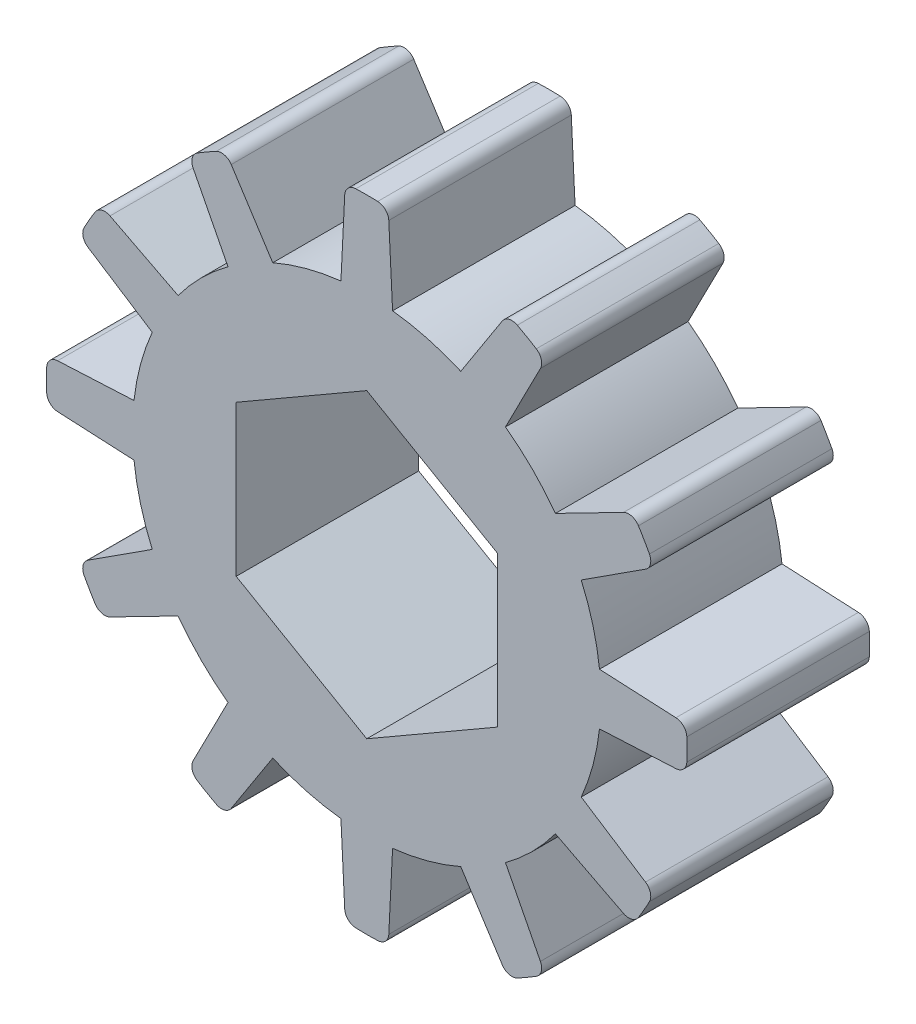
ISO-10303-21;
HEADER;
FILE_DESCRIPTION(('STEP AP214'),'2;1');
FILE_NAME('part.step','',(''),(''),'','','');
FILE_SCHEMA(('AUTOMOTIVE_DESIGN { 1 0 10303 214 1 1 1 1 }'));
ENDSEC;
DATA;
#1=APPLICATION_CONTEXT('core data for automotive mechanical design processes');
#2=APPLICATION_PROTOCOL_DEFINITION('international standard','automotive_design',2000,#1);
#3=PRODUCT_CONTEXT('',#1,'mechanical');
#4=PRODUCT('Part','Part','',(#3));
#5=PRODUCT_RELATED_PRODUCT_CATEGORY('part','',(#4));
#6=PRODUCT_DEFINITION_FORMATION('','',#4);
#7=PRODUCT_DEFINITION_CONTEXT('part definition',#1,'design');
#8=PRODUCT_DEFINITION('design','',#6,#7);
#9=PRODUCT_DEFINITION_SHAPE('','',#8);
#10=(LENGTH_UNIT() NAMED_UNIT(*) SI_UNIT(.MILLI.,.METRE.));
#11=(NAMED_UNIT(*) PLANE_ANGLE_UNIT() SI_UNIT($,.RADIAN.));
#12=(NAMED_UNIT(*) SI_UNIT($,.STERADIAN.) SOLID_ANGLE_UNIT());
#13=UNCERTAINTY_MEASURE_WITH_UNIT(LENGTH_MEASURE(1.E-05),#10,'distance_accuracy_value','');
#14=(GEOMETRIC_REPRESENTATION_CONTEXT(3) GLOBAL_UNCERTAINTY_ASSIGNED_CONTEXT((#13)) GLOBAL_UNIT_ASSIGNED_CONTEXT((#10,
#11,#12)) REPRESENTATION_CONTEXT('',''));
#15=CARTESIAN_POINT('',(0.,0.,0.));
#16=DIRECTION('',(0.,0.,1.));
#17=DIRECTION('',(1.,0.,0.));
#18=AXIS2_PLACEMENT_3D('',#15,#16,#17);
#19=CARTESIAN_POINT('',(0.,0.,3.18));
#20=DIRECTION('',(0.,0.,1.));
#21=DIRECTION('',(1.,0.,0.));
#22=AXIS2_PLACEMENT_3D('',#19,#20,#21);
#23=PLANE('',#22);
#24=DIRECTION('',(-0.866025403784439,-0.5,0.));
#25=VECTOR('',#24,1.);
#26=CARTESIAN_POINT('',(2.275,-1.3134718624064,3.18));
#27=LINE('',#26,#25);
#28=CARTESIAN_POINT('',(2.275,-1.3134718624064,3.18));
#29=VERTEX_POINT('',#28);
#30=CARTESIAN_POINT('',(0.,-2.6269437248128,3.18));
#31=VERTEX_POINT('',#30);
#32=EDGE_CURVE('E528',#29,#31,#27,.T.);
#33=ORIENTED_EDGE('',*,*,#32,.T.);
#34=DIRECTION('',(-0.866025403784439,0.5,0.));
#35=VECTOR('',#34,1.);
#36=CARTESIAN_POINT('',(0.,-2.6269437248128,3.18));
#37=LINE('',#36,#35);
#38=CARTESIAN_POINT('',(-2.275,-1.3134718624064,3.18));
#39=VERTEX_POINT('',#38);
#40=EDGE_CURVE('E540',#31,#39,#37,.T.);
#41=ORIENTED_EDGE('',*,*,#40,.T.);
#42=DIRECTION('',(0.,1.,0.));
#43=VECTOR('',#42,1.);
#44=CARTESIAN_POINT('',(-2.275,-1.3134718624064,3.18));
#45=LINE('',#44,#43);
#46=CARTESIAN_POINT('',(-2.275,1.3134718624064,3.18));
#47=VERTEX_POINT('',#46);
#48=EDGE_CURVE('E544',#39,#47,#45,.T.);
#49=ORIENTED_EDGE('',*,*,#48,.T.);
#50=DIRECTION('',(0.866025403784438,0.5,0.));
#51=VECTOR('',#50,1.);
#52=CARTESIAN_POINT('',(-2.275,1.3134718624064,3.18));
#53=LINE('',#52,#51);
#54=CARTESIAN_POINT('',(0.,2.6269437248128,3.18));
#55=VERTEX_POINT('',#54);
#56=EDGE_CURVE('E555',#47,#55,#53,.T.);
#57=ORIENTED_EDGE('',*,*,#56,.T.);
#58=DIRECTION('',(0.866025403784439,-0.5,0.));
#59=VECTOR('',#58,1.);
#60=CARTESIAN_POINT('',(0.,2.6269437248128,3.18));
#61=LINE('',#60,#59);
#62=CARTESIAN_POINT('',(2.275,1.3134718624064,3.18));
#63=VERTEX_POINT('',#62);
#64=EDGE_CURVE('E558',#55,#63,#61,.T.);
#65=ORIENTED_EDGE('',*,*,#64,.T.);
#66=DIRECTION('',(0.,-1.,0.));
#67=VECTOR('',#66,1.);
#68=CARTESIAN_POINT('',(2.275,1.3134718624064,3.18));
#69=LINE('',#68,#67);
#70=EDGE_CURVE('E536',#63,#29,#69,.T.);
#71=ORIENTED_EDGE('',*,*,#70,.T.);
#72=EDGE_LOOP('',(#33,#41,#49,#57,#65,#71));
#73=FACE_BOUND('',#72,.T.);
#74=DIRECTION('',(0.99877247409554,0.0495332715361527,0.));
#75=VECTOR('',#74,1.);
#76=CARTESIAN_POINT('',(5.56787554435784,-0.375,3.18));
#77=LINE('',#76,#75);
#78=CARTESIAN_POINT('',(4.0556003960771,-0.45,3.18));
#79=VERTEX_POINT('',#78);
#80=CARTESIAN_POINT('',(5.38724207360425,-0.383958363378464,3.18));
#81=VERTEX_POINT('',#80);
#82=EDGE_CURVE('E670',#79,#81,#77,.T.);
#83=ORIENTED_EDGE('',*,*,#82,.T.);
#84=CARTESIAN_POINT('',(5.37733541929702,-0.184203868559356,3.18));
#85=DIRECTION('',(0.,0.,1.));
#86=DIRECTION('',(1.,0.,0.));
#87=AXIS2_PLACEMENT_3D('',#84,#85,#86);
#88=CIRCLE('',#87,0.2);
#89=CARTESIAN_POINT('',(5.57721817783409,-0.191050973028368,3.18));
#90=VERTEX_POINT('',#89);
#91=EDGE_CURVE('E990',#81,#90,#88,.T.);
#92=ORIENTED_EDGE('',*,*,#91,.T.);
#93=CARTESIAN_POINT('',(0.,0.,3.18));
#94=DIRECTION('',(0.,0.,1.));
#95=DIRECTION('',(1.,0.,0.));
#96=AXIS2_PLACEMENT_3D('',#93,#94,#95);
#97=CIRCLE('',#96,5.58048950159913);
#98=CARTESIAN_POINT('',(5.57721817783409,0.191050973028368,3.18));
#99=VERTEX_POINT('',#98);
#100=EDGE_CURVE('E673',#90,#99,#97,.T.);
#101=ORIENTED_EDGE('',*,*,#100,.T.);
#102=CARTESIAN_POINT('',(5.37733541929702,0.184203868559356,3.18));
#103=DIRECTION('',(0.,0.,1.));
#104=DIRECTION('',(1.,0.,0.));
#105=AXIS2_PLACEMENT_3D('',#102,#103,#104);
#106=CIRCLE('',#105,0.2);
#107=CARTESIAN_POINT('',(5.38724207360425,0.383958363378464,3.18));
#108=VERTEX_POINT('',#107);
#109=EDGE_CURVE('E956',#99,#108,#106,.T.);
#110=ORIENTED_EDGE('',*,*,#109,.T.);
#111=DIRECTION('',(-0.99877247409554,0.0495332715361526,0.));
#112=VECTOR('',#111,1.);
#113=CARTESIAN_POINT('',(5.56787554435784,0.375,3.18));
#114=LINE('',#113,#112);
#115=CARTESIAN_POINT('',(4.0556003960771,0.45,3.18));
#116=VERTEX_POINT('',#115);
#117=EDGE_CURVE('E676',#108,#116,#114,.T.);
#118=ORIENTED_EDGE('',*,*,#117,.T.);
#119=CARTESIAN_POINT('',(0.,0.,3.18));
#120=DIRECTION('',(0.,0.,1.));
#121=DIRECTION('',(1.,0.,0.));
#122=AXIS2_PLACEMENT_3D('',#119,#120,#121);
#123=CIRCLE('',#122,4.08048950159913);
#124=CARTESIAN_POINT('',(3.737252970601,1.63808876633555,3.18));
#125=VERTEX_POINT('',#124);
#126=EDGE_CURVE('E678',#116,#125,#123,.T.);
#127=ORIENTED_EDGE('',*,*,#126,.T.);
#128=DIRECTION('',(0.840195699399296,0.542283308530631,0.));
#129=VECTOR('',#128,1.);
#130=CARTESIAN_POINT('',(5.009421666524,2.45917824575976,3.18));
#131=LINE('',#130,#129);
#132=CARTESIAN_POINT('',(4.85746767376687,2.36110334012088,3.18));
#133=VERTEX_POINT('',#132);
#134=EDGE_CURVE('E680',#125,#133,#131,.T.);
#135=ORIENTED_EDGE('',*,*,#134,.T.);
#136=CARTESIAN_POINT('',(4.74901101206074,2.52914248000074,3.18));
#137=DIRECTION('',(0.,0.,1.));
#138=DIRECTION('',(1.,0.,0.));
#139=AXIS2_PLACEMENT_3D('',#136,#137,#138);
#140=CIRCLE('',#139,0.2);
#141=CARTESIAN_POINT('',(4.92553811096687,2.62315409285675,3.18));
#142=VERTEX_POINT('',#141);
#143=EDGE_CURVE('E954',#133,#142,#140,.T.);
#144=ORIENTED_EDGE('',*,*,#143,.T.);
#145=CARTESIAN_POINT('',(0.,0.,3.18));
#146=DIRECTION('',(0.,0.,1.));
#147=DIRECTION('',(1.,0.,0.));
#148=AXIS2_PLACEMENT_3D('',#145,#146,#147);
#149=CIRCLE('',#148,5.58048950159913);
#150=CARTESIAN_POINT('',(4.7344871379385,2.95406408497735,3.18));
#151=VERTEX_POINT('',#150);
#152=EDGE_CURVE('E683',#142,#151,#149,.T.);
#153=ORIENTED_EDGE('',*,*,#152,.T.);
#154=CARTESIAN_POINT('',(4.56480714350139,2.84819293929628,3.18));
#155=DIRECTION('',(0.,0.,1.));
#156=DIRECTION('',(1.,0.,0.));
#157=AXIS2_PLACEMENT_3D('',#154,#155,#156);
#158=CIRCLE('',#157,0.2);
#159=CARTESIAN_POINT('',(4.4735093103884,3.02613873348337,3.18));
#160=VERTEX_POINT('',#159);
#161=EDGE_CURVE('E952',#151,#160,#158,.T.);
#162=ORIENTED_EDGE('',*,*,#161,.T.);
#163=DIRECTION('',(-0.889728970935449,-0.456489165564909,0.));
#164=VECTOR('',#163,1.);
#165=CARTESIAN_POINT('',(4.634421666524,3.10869729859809,3.18));
#166=LINE('',#165,#164);
#167=CARTESIAN_POINT('',(3.287252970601,2.41751162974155,3.18));
#168=VERTEX_POINT('',#167);
#169=EDGE_CURVE('E686',#160,#168,#166,.T.);
#170=ORIENTED_EDGE('',*,*,#169,.T.);
#171=CARTESIAN_POINT('',(0.,0.,3.18));
#172=DIRECTION('',(0.,0.,1.));
#173=DIRECTION('',(1.,0.,0.));
#174=AXIS2_PLACEMENT_3D('',#171,#172,#173);
#175=CIRCLE('',#174,4.08048950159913);
#176=CARTESIAN_POINT('',(2.41751162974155,3.287252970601,3.18));
#177=VERTEX_POINT('',#176);
#178=EDGE_CURVE('E688',#168,#177,#175,.T.);
#179=ORIENTED_EDGE('',*,*,#178,.T.);
#180=DIRECTION('',(0.456489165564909,0.889728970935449,0.));
#181=VECTOR('',#180,1.);
#182=CARTESIAN_POINT('',(3.10869729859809,4.634421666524,3.18));
#183=LINE('',#182,#181);
#184=CARTESIAN_POINT('',(3.02613873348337,4.47350931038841,3.18));
#185=VERTEX_POINT('',#184);
#186=EDGE_CURVE('E690',#177,#185,#183,.T.);
#187=ORIENTED_EDGE('',*,*,#186,.T.);
#188=CARTESIAN_POINT('',(2.84819293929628,4.56480714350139,3.18));
#189=DIRECTION('',(0.,0.,1.));
#190=DIRECTION('',(1.,0.,0.));
#191=AXIS2_PLACEMENT_3D('',#188,#189,#190);
#192=CIRCLE('',#191,0.2);
#193=CARTESIAN_POINT('',(2.95406408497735,4.7344871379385,3.18));
#194=VERTEX_POINT('',#193);
#195=EDGE_CURVE('E950',#185,#194,#192,.T.);
#196=ORIENTED_EDGE('',*,*,#195,.T.);
#197=CARTESIAN_POINT('',(0.,0.,3.18));
#198=DIRECTION('',(0.,0.,1.));
#199=DIRECTION('',(1.,0.,0.));
#200=AXIS2_PLACEMENT_3D('',#197,#198,#199);
#201=CIRCLE('',#200,5.58048950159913);
#202=CARTESIAN_POINT('',(2.62315409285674,4.92553811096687,3.18));
#203=VERTEX_POINT('',#202);
#204=EDGE_CURVE('E693',#194,#203,#201,.T.);
#205=ORIENTED_EDGE('',*,*,#204,.T.);
#206=CARTESIAN_POINT('',(2.52914248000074,4.74901101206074,3.18));
#207=DIRECTION('',(0.,0.,1.));
#208=DIRECTION('',(1.,0.,0.));
#209=AXIS2_PLACEMENT_3D('',#206,#207,#208);
#210=CIRCLE('',#209,0.2);
#211=CARTESIAN_POINT('',(2.36110334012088,4.85746767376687,3.18));
#212=VERTEX_POINT('',#211);
#213=EDGE_CURVE('E59',#203,#212,#210,.T.);
#214=ORIENTED_EDGE('',*,*,#213,.T.);
#215=DIRECTION('',(-0.54228330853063,-0.840195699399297,0.));
#216=VECTOR('',#215,1.);
#217=CARTESIAN_POINT('',(2.45917824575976,5.009421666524,3.18));
#218=LINE('',#217,#216);
#219=CARTESIAN_POINT('',(1.63808876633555,3.737252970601,3.18));
#220=VERTEX_POINT('',#219);
#221=EDGE_CURVE('E695',#212,#220,#218,.T.);
#222=ORIENTED_EDGE('',*,*,#221,.T.);
#223=CARTESIAN_POINT('',(0.,0.,3.18));
#224=DIRECTION('',(0.,0.,1.));
#225=DIRECTION('',(1.,0.,0.));
#226=AXIS2_PLACEMENT_3D('',#223,#224,#225);
#227=CIRCLE('',#226,4.08048950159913);
#228=CARTESIAN_POINT('',(0.45,4.0556003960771,3.18));
#229=VERTEX_POINT('',#228);
#230=EDGE_CURVE('E697',#220,#229,#227,.T.);
#231=ORIENTED_EDGE('',*,*,#230,.T.);
#232=DIRECTION('',(-0.0495332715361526,0.99877247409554,0.));
#233=VECTOR('',#232,1.);
#234=CARTESIAN_POINT('',(0.375,5.56787554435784,3.18));
#235=LINE('',#234,#233);
#236=CARTESIAN_POINT('',(0.383958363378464,5.38724207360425,3.18));
#237=VERTEX_POINT('',#236);
#238=EDGE_CURVE('E699',#229,#237,#235,.T.);
#239=ORIENTED_EDGE('',*,*,#238,.T.);
#240=CARTESIAN_POINT('',(0.184203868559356,5.37733541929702,3.18));
#241=DIRECTION('',(0.,0.,1.));
#242=DIRECTION('',(1.,0.,0.));
#243=AXIS2_PLACEMENT_3D('',#240,#241,#242);
#244=CIRCLE('',#243,0.2);
#245=CARTESIAN_POINT('',(0.191050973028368,5.57721817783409,3.18));
#246=VERTEX_POINT('',#245);
#247=EDGE_CURVE('E947',#237,#246,#244,.T.);
#248=ORIENTED_EDGE('',*,*,#247,.T.);
#249=CARTESIAN_POINT('',(0.,0.,3.18));
#250=DIRECTION('',(0.,0.,1.));
#251=DIRECTION('',(1.,0.,0.));
#252=AXIS2_PLACEMENT_3D('',#249,#250,#251);
#253=CIRCLE('',#252,5.58048950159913);
#254=CARTESIAN_POINT('',(-0.191050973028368,5.57721817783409,3.18));
#255=VERTEX_POINT('',#254);
#256=EDGE_CURVE('E582',#246,#255,#253,.T.);
#257=ORIENTED_EDGE('',*,*,#256,.T.);
#258=CARTESIAN_POINT('',(-0.184203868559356,5.37733541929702,3.18));
#259=DIRECTION('',(0.,0.,1.));
#260=DIRECTION('',(1.,0.,0.));
#261=AXIS2_PLACEMENT_3D('',#258,#259,#260);
#262=CIRCLE('',#261,0.2);
#263=CARTESIAN_POINT('',(-0.383958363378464,5.38724207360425,3.18));
#264=VERTEX_POINT('',#263);
#265=EDGE_CURVE('E945',#255,#264,#262,.T.);
#266=ORIENTED_EDGE('',*,*,#265,.T.);
#267=DIRECTION('',(-0.0495332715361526,-0.99877247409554,0.));
#268=VECTOR('',#267,1.);
#269=CARTESIAN_POINT('',(-0.375,5.56787554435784,3.18));
#270=LINE('',#269,#268);
#271=CARTESIAN_POINT('',(-0.45,4.0556003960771,3.18));
#272=VERTEX_POINT('',#271);
#273=EDGE_CURVE('E585',#264,#272,#270,.T.);
#274=ORIENTED_EDGE('',*,*,#273,.T.);
#275=CARTESIAN_POINT('',(0.,0.,3.18));
#276=DIRECTION('',(0.,0.,1.));
#277=DIRECTION('',(1.,0.,0.));
#278=AXIS2_PLACEMENT_3D('',#275,#276,#277);
#279=CIRCLE('',#278,4.08048950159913);
#280=CARTESIAN_POINT('',(-1.63808876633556,3.737252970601,3.18));
#281=VERTEX_POINT('',#280);
#282=EDGE_CURVE('E588',#272,#281,#279,.T.);
#283=ORIENTED_EDGE('',*,*,#282,.T.);
#284=DIRECTION('',(-0.542283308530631,0.840195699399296,0.));
#285=VECTOR('',#284,1.);
#286=CARTESIAN_POINT('',(-2.45917824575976,5.009421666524,3.18));
#287=LINE('',#286,#285);
#288=CARTESIAN_POINT('',(-2.36110334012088,4.85746767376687,3.18));
#289=VERTEX_POINT('',#288);
#290=EDGE_CURVE('E590',#281,#289,#287,.T.);
#291=ORIENTED_EDGE('',*,*,#290,.T.);
#292=CARTESIAN_POINT('',(-2.52914248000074,4.74901101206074,3.18));
#293=DIRECTION('',(0.,0.,1.));
#294=DIRECTION('',(1.,0.,0.));
#295=AXIS2_PLACEMENT_3D('',#292,#293,#294);
#296=CIRCLE('',#295,0.2);
#297=CARTESIAN_POINT('',(-2.62315409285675,4.92553811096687,3.18));
#298=VERTEX_POINT('',#297);
#299=EDGE_CURVE('E958',#289,#298,#296,.T.);
#300=ORIENTED_EDGE('',*,*,#299,.T.);
#301=CARTESIAN_POINT('',(0.,0.,3.18));
#302=DIRECTION('',(0.,0.,1.));
#303=DIRECTION('',(1.,0.,0.));
#304=AXIS2_PLACEMENT_3D('',#301,#302,#303);
#305=CIRCLE('',#304,5.58048950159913);
#306=CARTESIAN_POINT('',(-2.95406408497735,4.7344871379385,3.18));
#307=VERTEX_POINT('',#306);
#308=EDGE_CURVE('E593',#298,#307,#305,.T.);
#309=ORIENTED_EDGE('',*,*,#308,.T.);
#310=CARTESIAN_POINT('',(-2.84819293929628,4.56480714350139,3.18));
#311=DIRECTION('',(0.,0.,1.));
#312=DIRECTION('',(1.,0.,0.));
#313=AXIS2_PLACEMENT_3D('',#310,#311,#312);
#314=CIRCLE('',#313,0.2);
#315=CARTESIAN_POINT('',(-3.02613873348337,4.4735093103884,3.18));
#316=VERTEX_POINT('',#315);
#317=EDGE_CURVE('E960',#307,#316,#314,.T.);
#318=ORIENTED_EDGE('',*,*,#317,.T.);
#319=DIRECTION('',(0.456489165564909,-0.889728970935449,0.));
#320=VECTOR('',#319,1.);
#321=CARTESIAN_POINT('',(-3.10869729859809,4.634421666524,3.18));
#322=LINE('',#321,#320);
#323=CARTESIAN_POINT('',(-2.41751162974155,3.287252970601,3.18));
#324=VERTEX_POINT('',#323);
#325=EDGE_CURVE('E596',#316,#324,#322,.T.);
#326=ORIENTED_EDGE('',*,*,#325,.T.);
#327=CARTESIAN_POINT('',(0.,0.,3.18));
#328=DIRECTION('',(0.,0.,1.));
#329=DIRECTION('',(1.,0.,0.));
#330=AXIS2_PLACEMENT_3D('',#327,#328,#329);
#331=CIRCLE('',#330,4.08048950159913);
#332=CARTESIAN_POINT('',(-3.287252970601,2.41751162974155,3.18));
#333=VERTEX_POINT('',#332);
#334=EDGE_CURVE('E598',#324,#333,#331,.T.);
#335=ORIENTED_EDGE('',*,*,#334,.T.);
#336=DIRECTION('',(-0.889728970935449,0.456489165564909,0.));
#337=VECTOR('',#336,1.);
#338=CARTESIAN_POINT('',(-4.634421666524,3.10869729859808,3.18));
#339=LINE('',#338,#337);
#340=CARTESIAN_POINT('',(-4.47350931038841,3.02613873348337,3.18));
#341=VERTEX_POINT('',#340);
#342=EDGE_CURVE('E600',#333,#341,#339,.T.);
#343=ORIENTED_EDGE('',*,*,#342,.T.);
#344=CARTESIAN_POINT('',(-4.56480714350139,2.84819293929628,3.18));
#345=DIRECTION('',(0.,0.,1.));
#346=DIRECTION('',(1.,0.,0.));
#347=AXIS2_PLACEMENT_3D('',#344,#345,#346);
#348=CIRCLE('',#347,0.2);
#349=CARTESIAN_POINT('',(-4.7344871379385,2.95406408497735,3.18));
#350=VERTEX_POINT('',#349);
#351=EDGE_CURVE('E962',#341,#350,#348,.T.);
#352=ORIENTED_EDGE('',*,*,#351,.T.);
#353=CARTESIAN_POINT('',(0.,0.,3.18));
#354=DIRECTION('',(0.,0.,1.));
#355=DIRECTION('',(1.,0.,0.));
#356=AXIS2_PLACEMENT_3D('',#353,#354,#355);
#357=CIRCLE('',#356,5.58048950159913);
#358=CARTESIAN_POINT('',(-4.92553811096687,2.62315409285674,3.18));
#359=VERTEX_POINT('',#358);
#360=EDGE_CURVE('E603',#350,#359,#357,.T.);
#361=ORIENTED_EDGE('',*,*,#360,.T.);
#362=CARTESIAN_POINT('',(-4.74901101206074,2.52914248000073,3.18));
#363=DIRECTION('',(0.,0.,1.));
#364=DIRECTION('',(1.,0.,0.));
#365=AXIS2_PLACEMENT_3D('',#362,#363,#364);
#366=CIRCLE('',#365,0.2);
#367=CARTESIAN_POINT('',(-4.85746767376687,2.36110334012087,3.18));
#368=VERTEX_POINT('',#367);
#369=EDGE_CURVE('E964',#359,#368,#366,.T.);
#370=ORIENTED_EDGE('',*,*,#369,.T.);
#371=DIRECTION('',(0.840195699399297,-0.54228330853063,0.));
#372=VECTOR('',#371,1.);
#373=CARTESIAN_POINT('',(-5.009421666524,2.45917824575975,3.18));
#374=LINE('',#373,#372);
#375=CARTESIAN_POINT('',(-3.737252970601,1.63808876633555,3.18));
#376=VERTEX_POINT('',#375);
#377=EDGE_CURVE('E606',#368,#376,#374,.T.);
#378=ORIENTED_EDGE('',*,*,#377,.T.);
#379=CARTESIAN_POINT('',(0.,0.,3.18));
#380=DIRECTION('',(0.,0.,1.));
#381=DIRECTION('',(1.,0.,0.));
#382=AXIS2_PLACEMENT_3D('',#379,#380,#381);
#383=CIRCLE('',#382,4.08048950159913);
#384=CARTESIAN_POINT('',(-4.0556003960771,0.449999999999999,3.18));
#385=VERTEX_POINT('',#384);
#386=EDGE_CURVE('E608',#376,#385,#383,.T.);
#387=ORIENTED_EDGE('',*,*,#386,.T.);
#388=DIRECTION('',(-0.99877247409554,-0.0495332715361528,0.));
#389=VECTOR('',#388,1.);
#390=CARTESIAN_POINT('',(-5.56787554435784,0.374999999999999,3.18));
#391=LINE('',#390,#389);
#392=CARTESIAN_POINT('',(-5.38724207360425,0.383958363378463,3.18));
#393=VERTEX_POINT('',#392);
#394=EDGE_CURVE('E610',#385,#393,#391,.T.);
#395=ORIENTED_EDGE('',*,*,#394,.T.);
#396=CARTESIAN_POINT('',(-5.37733541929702,0.184203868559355,3.18));
#397=DIRECTION('',(0.,0.,1.));
#398=DIRECTION('',(1.,0.,0.));
#399=AXIS2_PLACEMENT_3D('',#396,#397,#398);
#400=CIRCLE('',#399,0.2);
#401=CARTESIAN_POINT('',(-5.57721817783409,0.191050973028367,3.18));
#402=VERTEX_POINT('',#401);
#403=EDGE_CURVE('E966',#393,#402,#400,.T.);
#404=ORIENTED_EDGE('',*,*,#403,.T.);
#405=CARTESIAN_POINT('',(0.,0.,3.18));
#406=DIRECTION('',(0.,0.,1.));
#407=DIRECTION('',(1.,0.,0.));
#408=AXIS2_PLACEMENT_3D('',#405,#406,#407);
#409=CIRCLE('',#408,5.58048950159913);
#410=CARTESIAN_POINT('',(-5.57721817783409,-0.191050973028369,3.18));
#411=VERTEX_POINT('',#410);
#412=EDGE_CURVE('E613',#402,#411,#409,.T.);
#413=ORIENTED_EDGE('',*,*,#412,.T.);
#414=CARTESIAN_POINT('',(-5.37733541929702,-0.184203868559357,3.18));
#415=DIRECTION('',(0.,0.,1.));
#416=DIRECTION('',(1.,0.,0.));
#417=AXIS2_PLACEMENT_3D('',#414,#415,#416);
#418=CIRCLE('',#417,0.2);
#419=CARTESIAN_POINT('',(-5.38724207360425,-0.383958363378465,3.18));
#420=VERTEX_POINT('',#419);
#421=EDGE_CURVE('E968',#411,#420,#418,.T.);
#422=ORIENTED_EDGE('',*,*,#421,.T.);
#423=DIRECTION('',(0.99877247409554,-0.0495332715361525,0.));
#424=VECTOR('',#423,1.);
#425=CARTESIAN_POINT('',(-5.56787554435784,-0.375000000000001,3.18));
#426=LINE('',#425,#424);
#427=CARTESIAN_POINT('',(-4.0556003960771,-0.449999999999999,3.18));
#428=VERTEX_POINT('',#427);
#429=EDGE_CURVE('E616',#420,#428,#426,.T.);
#430=ORIENTED_EDGE('',*,*,#429,.T.);
#431=CARTESIAN_POINT('',(0.,0.,3.18));
#432=DIRECTION('',(0.,0.,1.));
#433=DIRECTION('',(1.,0.,0.));
#434=AXIS2_PLACEMENT_3D('',#431,#432,#433);
#435=CIRCLE('',#434,4.08048950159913);
#436=CARTESIAN_POINT('',(-3.737252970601,-1.63808876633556,3.18));
#437=VERTEX_POINT('',#436);
#438=EDGE_CURVE('E618',#428,#437,#435,.T.);
#439=ORIENTED_EDGE('',*,*,#438,.T.);
#440=DIRECTION('',(-0.840195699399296,-0.542283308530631,0.));
#441=VECTOR('',#440,1.);
#442=CARTESIAN_POINT('',(-5.009421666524,-2.45917824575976,3.18));
#443=LINE('',#442,#441);
#444=CARTESIAN_POINT('',(-4.85746767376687,-2.36110334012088,3.18));
#445=VERTEX_POINT('',#444);
#446=EDGE_CURVE('E620',#437,#445,#443,.T.);
#447=ORIENTED_EDGE('',*,*,#446,.T.);
#448=CARTESIAN_POINT('',(-4.74901101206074,-2.52914248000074,3.18));
#449=DIRECTION('',(0.,0.,1.));
#450=DIRECTION('',(1.,0.,0.));
#451=AXIS2_PLACEMENT_3D('',#448,#449,#450);
#452=CIRCLE('',#451,0.2);
#453=CARTESIAN_POINT('',(-4.92553811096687,-2.62315409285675,3.18));
#454=VERTEX_POINT('',#453);
#455=EDGE_CURVE('E970',#445,#454,#452,.T.);
#456=ORIENTED_EDGE('',*,*,#455,.T.);
#457=CARTESIAN_POINT('',(0.,0.,3.18));
#458=DIRECTION('',(0.,0.,1.));
#459=DIRECTION('',(1.,0.,0.));
#460=AXIS2_PLACEMENT_3D('',#457,#458,#459);
#461=CIRCLE('',#460,5.58048950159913);
#462=CARTESIAN_POINT('',(-4.7344871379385,-2.95406408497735,3.18));
#463=VERTEX_POINT('',#462);
#464=EDGE_CURVE('E623',#454,#463,#461,.T.);
#465=ORIENTED_EDGE('',*,*,#464,.T.);
#466=CARTESIAN_POINT('',(-4.56480714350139,-2.84819293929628,3.18));
#467=DIRECTION('',(0.,0.,1.));
#468=DIRECTION('',(1.,0.,0.));
#469=AXIS2_PLACEMENT_3D('',#466,#467,#468);
#470=CIRCLE('',#469,0.2);
#471=CARTESIAN_POINT('',(-4.4735093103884,-3.02613873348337,3.18));
#472=VERTEX_POINT('',#471);
#473=EDGE_CURVE('E972',#463,#472,#470,.T.);
#474=ORIENTED_EDGE('',*,*,#473,.T.);
#475=DIRECTION('',(0.889728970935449,0.456489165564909,0.));
#476=VECTOR('',#475,1.);
#477=CARTESIAN_POINT('',(-4.634421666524,-3.10869729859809,3.18));
#478=LINE('',#477,#476);
#479=CARTESIAN_POINT('',(-3.287252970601,-2.41751162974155,3.18));
#480=VERTEX_POINT('',#479);
#481=EDGE_CURVE('E626',#472,#480,#478,.T.);
#482=ORIENTED_EDGE('',*,*,#481,.T.);
#483=CARTESIAN_POINT('',(0.,0.,3.18));
#484=DIRECTION('',(0.,0.,1.));
#485=DIRECTION('',(1.,0.,0.));
#486=AXIS2_PLACEMENT_3D('',#483,#484,#485);
#487=CIRCLE('',#486,4.08048950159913);
#488=CARTESIAN_POINT('',(-2.41751162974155,-3.287252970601,3.18));
#489=VERTEX_POINT('',#488);
#490=EDGE_CURVE('E628',#480,#489,#487,.T.);
#491=ORIENTED_EDGE('',*,*,#490,.T.);
#492=DIRECTION('',(-0.456489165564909,-0.889728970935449,0.));
#493=VECTOR('',#492,1.);
#494=CARTESIAN_POINT('',(-3.10869729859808,-4.634421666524,3.18));
#495=LINE('',#494,#493);
#496=CARTESIAN_POINT('',(-3.02613873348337,-4.47350931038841,3.18));
#497=VERTEX_POINT('',#496);
#498=EDGE_CURVE('E630',#489,#497,#495,.T.);
#499=ORIENTED_EDGE('',*,*,#498,.T.);
#500=CARTESIAN_POINT('',(-2.84819293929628,-4.56480714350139,3.18));
#501=DIRECTION('',(0.,0.,1.));
#502=DIRECTION('',(1.,0.,0.));
#503=AXIS2_PLACEMENT_3D('',#500,#501,#502);
#504=CIRCLE('',#503,0.2);
#505=CARTESIAN_POINT('',(-2.95406408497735,-4.7344871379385,3.18));
#506=VERTEX_POINT('',#505);
#507=EDGE_CURVE('E986',#497,#506,#504,.T.);
#508=ORIENTED_EDGE('',*,*,#507,.T.);
#509=CARTESIAN_POINT('',(0.,0.,3.18));
#510=DIRECTION('',(0.,0.,1.));
#511=DIRECTION('',(1.,0.,0.));
#512=AXIS2_PLACEMENT_3D('',#509,#510,#511);
#513=CIRCLE('',#512,5.58048950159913);
#514=CARTESIAN_POINT('',(-2.62315409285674,-4.92553811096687,3.18));
#515=VERTEX_POINT('',#514);
#516=EDGE_CURVE('E633',#506,#515,#513,.T.);
#517=ORIENTED_EDGE('',*,*,#516,.T.);
#518=CARTESIAN_POINT('',(-2.52914248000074,-4.74901101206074,3.18));
#519=DIRECTION('',(0.,0.,1.));
#520=DIRECTION('',(1.,0.,0.));
#521=AXIS2_PLACEMENT_3D('',#518,#519,#520);
#522=CIRCLE('',#521,0.2);
#523=CARTESIAN_POINT('',(-2.36110334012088,-4.85746767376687,3.18));
#524=VERTEX_POINT('',#523);
#525=EDGE_CURVE('E988',#515,#524,#522,.T.);
#526=ORIENTED_EDGE('',*,*,#525,.T.);
#527=DIRECTION('',(0.542283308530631,0.840195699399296,0.));
#528=VECTOR('',#527,1.);
#529=CARTESIAN_POINT('',(-2.45917824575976,-5.009421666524,3.18));
#530=LINE('',#529,#528);
#531=CARTESIAN_POINT('',(-1.63808876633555,-3.737252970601,3.18));
#532=VERTEX_POINT('',#531);
#533=EDGE_CURVE('E636',#524,#532,#530,.T.);
#534=ORIENTED_EDGE('',*,*,#533,.T.);
#535=CARTESIAN_POINT('',(0.,0.,3.18));
#536=DIRECTION('',(0.,0.,1.));
#537=DIRECTION('',(1.,0.,0.));
#538=AXIS2_PLACEMENT_3D('',#535,#536,#537);
#539=CIRCLE('',#538,4.08048950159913);
#540=CARTESIAN_POINT('',(-0.45,-4.0556003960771,3.18));
#541=VERTEX_POINT('',#540);
#542=EDGE_CURVE('E638',#532,#541,#539,.T.);
#543=ORIENTED_EDGE('',*,*,#542,.T.);
#544=DIRECTION('',(0.0495332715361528,-0.99877247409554,0.));
#545=VECTOR('',#544,1.);
#546=CARTESIAN_POINT('',(-0.374999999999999,-5.56787554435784,3.18));
#547=LINE('',#546,#545);
#548=CARTESIAN_POINT('',(-0.383958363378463,-5.38724207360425,3.18));
#549=VERTEX_POINT('',#548);
#550=EDGE_CURVE('E640',#541,#549,#547,.T.);
#551=ORIENTED_EDGE('',*,*,#550,.T.);
#552=CARTESIAN_POINT('',(-0.184203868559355,-5.37733541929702,3.18));
#553=DIRECTION('',(0.,0.,1.));
#554=DIRECTION('',(1.,0.,0.));
#555=AXIS2_PLACEMENT_3D('',#552,#553,#554);
#556=CIRCLE('',#555,0.2);
#557=CARTESIAN_POINT('',(-0.191050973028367,-5.57721817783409,3.18));
#558=VERTEX_POINT('',#557);
#559=EDGE_CURVE('E982',#549,#558,#556,.T.);
#560=ORIENTED_EDGE('',*,*,#559,.T.);
#561=CARTESIAN_POINT('',(0.,0.,3.18));
#562=DIRECTION('',(0.,0.,1.));
#563=DIRECTION('',(1.,0.,0.));
#564=AXIS2_PLACEMENT_3D('',#561,#562,#563);
#565=CIRCLE('',#564,5.58048950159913);
#566=CARTESIAN_POINT('',(0.191050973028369,-5.57721817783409,3.18));
#567=VERTEX_POINT('',#566);
#568=EDGE_CURVE('E643',#558,#567,#565,.T.);
#569=ORIENTED_EDGE('',*,*,#568,.T.);
#570=CARTESIAN_POINT('',(0.184203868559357,-5.37733541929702,3.18));
#571=DIRECTION('',(0.,0.,1.));
#572=DIRECTION('',(1.,0.,0.));
#573=AXIS2_PLACEMENT_3D('',#570,#571,#572);
#574=CIRCLE('',#573,0.2);
#575=CARTESIAN_POINT('',(0.383958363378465,-5.38724207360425,3.18));
#576=VERTEX_POINT('',#575);
#577=EDGE_CURVE('E984',#567,#576,#574,.T.);
#578=ORIENTED_EDGE('',*,*,#577,.T.);
#579=DIRECTION('',(0.0495332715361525,0.99877247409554,0.));
#580=VECTOR('',#579,1.);
#581=CARTESIAN_POINT('',(0.375000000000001,-5.56787554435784,3.18));
#582=LINE('',#581,#580);
#583=CARTESIAN_POINT('',(0.449999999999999,-4.0556003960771,3.18));
#584=VERTEX_POINT('',#583);
#585=EDGE_CURVE('E646',#576,#584,#582,.T.);
#586=ORIENTED_EDGE('',*,*,#585,.T.);
#587=CARTESIAN_POINT('',(0.,0.,3.18));
#588=DIRECTION('',(0.,0.,1.));
#589=DIRECTION('',(1.,0.,0.));
#590=AXIS2_PLACEMENT_3D('',#587,#588,#589);
#591=CIRCLE('',#590,4.08048950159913);
#592=CARTESIAN_POINT('',(1.63808876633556,-3.737252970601,3.18));
#593=VERTEX_POINT('',#592);
#594=EDGE_CURVE('E648',#584,#593,#591,.T.);
#595=ORIENTED_EDGE('',*,*,#594,.T.);
#596=DIRECTION('',(0.542283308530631,-0.840195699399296,0.));
#597=VECTOR('',#596,1.);
#598=CARTESIAN_POINT('',(2.45917824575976,-5.009421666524,3.18));
#599=LINE('',#598,#597);
#600=CARTESIAN_POINT('',(2.36110334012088,-4.85746767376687,3.18));
#601=VERTEX_POINT('',#600);
#602=EDGE_CURVE('E650',#593,#601,#599,.T.);
#603=ORIENTED_EDGE('',*,*,#602,.T.);
#604=CARTESIAN_POINT('',(2.52914248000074,-4.74901101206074,3.18));
#605=DIRECTION('',(0.,0.,1.));
#606=DIRECTION('',(1.,0.,0.));
#607=AXIS2_PLACEMENT_3D('',#604,#605,#606);
#608=CIRCLE('',#607,0.2);
#609=CARTESIAN_POINT('',(2.62315409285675,-4.92553811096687,3.18));
#610=VERTEX_POINT('',#609);
#611=EDGE_CURVE('E978',#601,#610,#608,.T.);
#612=ORIENTED_EDGE('',*,*,#611,.T.);
#613=CARTESIAN_POINT('',(0.,0.,3.18));
#614=DIRECTION('',(0.,0.,1.));
#615=DIRECTION('',(1.,0.,0.));
#616=AXIS2_PLACEMENT_3D('',#613,#614,#615);
#617=CIRCLE('',#616,5.58048950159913);
#618=CARTESIAN_POINT('',(2.95406408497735,-4.7344871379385,3.18));
#619=VERTEX_POINT('',#618);
#620=EDGE_CURVE('E653',#610,#619,#617,.T.);
#621=ORIENTED_EDGE('',*,*,#620,.T.);
#622=CARTESIAN_POINT('',(2.84819293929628,-4.56480714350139,3.18));
#623=DIRECTION('',(0.,0.,1.));
#624=DIRECTION('',(1.,0.,0.));
#625=AXIS2_PLACEMENT_3D('',#622,#623,#624);
#626=CIRCLE('',#625,0.2);
#627=CARTESIAN_POINT('',(3.02613873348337,-4.4735093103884,3.18));
#628=VERTEX_POINT('',#627);
#629=EDGE_CURVE('E980',#619,#628,#626,.T.);
#630=ORIENTED_EDGE('',*,*,#629,.T.);
#631=DIRECTION('',(-0.456489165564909,0.889728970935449,0.));
#632=VECTOR('',#631,1.);
#633=CARTESIAN_POINT('',(3.10869729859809,-4.634421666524,3.18));
#634=LINE('',#633,#632);
#635=CARTESIAN_POINT('',(2.41751162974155,-3.287252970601,3.18));
#636=VERTEX_POINT('',#635);
#637=EDGE_CURVE('E656',#628,#636,#634,.T.);
#638=ORIENTED_EDGE('',*,*,#637,.T.);
#639=CARTESIAN_POINT('',(0.,0.,3.18));
#640=DIRECTION('',(0.,0.,1.));
#641=DIRECTION('',(1.,0.,0.));
#642=AXIS2_PLACEMENT_3D('',#639,#640,#641);
#643=CIRCLE('',#642,4.08048950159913);
#644=CARTESIAN_POINT('',(3.287252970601,-2.41751162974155,3.18));
#645=VERTEX_POINT('',#644);
#646=EDGE_CURVE('E658',#636,#645,#643,.T.);
#647=ORIENTED_EDGE('',*,*,#646,.T.);
#648=DIRECTION('',(0.889728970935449,-0.456489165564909,0.));
#649=VECTOR('',#648,1.);
#650=CARTESIAN_POINT('',(4.634421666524,-3.10869729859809,3.18));
#651=LINE('',#650,#649);
#652=CARTESIAN_POINT('',(4.4735093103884,-3.02613873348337,3.18));
#653=VERTEX_POINT('',#652);
#654=EDGE_CURVE('E660',#645,#653,#651,.T.);
#655=ORIENTED_EDGE('',*,*,#654,.T.);
#656=CARTESIAN_POINT('',(4.56480714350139,-2.84819293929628,3.18));
#657=DIRECTION('',(0.,0.,1.));
#658=DIRECTION('',(1.,0.,0.));
#659=AXIS2_PLACEMENT_3D('',#656,#657,#658);
#660=CIRCLE('',#659,0.2);
#661=CARTESIAN_POINT('',(4.7344871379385,-2.95406408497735,3.18));
#662=VERTEX_POINT('',#661);
#663=EDGE_CURVE('E974',#653,#662,#660,.T.);
#664=ORIENTED_EDGE('',*,*,#663,.T.);
#665=CARTESIAN_POINT('',(0.,0.,3.18));
#666=DIRECTION('',(0.,0.,1.));
#667=DIRECTION('',(1.,0.,0.));
#668=AXIS2_PLACEMENT_3D('',#665,#666,#667);
#669=CIRCLE('',#668,5.58048950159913);
#670=CARTESIAN_POINT('',(4.92553811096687,-2.62315409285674,3.18));
#671=VERTEX_POINT('',#670);
#672=EDGE_CURVE('E663',#662,#671,#669,.T.);
#673=ORIENTED_EDGE('',*,*,#672,.T.);
#674=CARTESIAN_POINT('',(4.74901101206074,-2.52914248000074,3.18));
#675=DIRECTION('',(0.,0.,1.));
#676=DIRECTION('',(1.,0.,0.));
#677=AXIS2_PLACEMENT_3D('',#674,#675,#676);
#678=CIRCLE('',#677,0.2);
#679=CARTESIAN_POINT('',(4.85746767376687,-2.36110334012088,3.18));
#680=VERTEX_POINT('',#679);
#681=EDGE_CURVE('E976',#671,#680,#678,.T.);
#682=ORIENTED_EDGE('',*,*,#681,.T.);
#683=DIRECTION('',(-0.840195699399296,0.542283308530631,0.));
#684=VECTOR('',#683,1.);
#685=CARTESIAN_POINT('',(5.009421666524,-2.45917824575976,3.18));
#686=LINE('',#685,#684);
#687=CARTESIAN_POINT('',(3.737252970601,-1.63808876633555,3.18));
#688=VERTEX_POINT('',#687);
#689=EDGE_CURVE('E666',#680,#688,#686,.T.);
#690=ORIENTED_EDGE('',*,*,#689,.T.);
#691=CARTESIAN_POINT('',(0.,0.,3.18));
#692=DIRECTION('',(0.,0.,1.));
#693=DIRECTION('',(1.,0.,0.));
#694=AXIS2_PLACEMENT_3D('',#691,#692,#693);
#695=CIRCLE('',#694,4.08048950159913);
#696=EDGE_CURVE('E668',#688,#79,#695,.T.);
#697=ORIENTED_EDGE('',*,*,#696,.T.);
#698=EDGE_LOOP('',(#83,#92,#101,#110,#118,#127,#135,#144,#153,#162,#170,#179,#187,#196,#205,
#214,#222,#231,#239,#248,#257,#266,#274,#283,#291,#300,#309,#318,#326,#335,#343,#352,#361,#370,
#378,#387,#395,#404,#413,#422,#430,#439,#447,#456,#465,#474,#482,#491,#499,#508,#517,#526,#534,
#543,#551,#560,#569,#578,#586,#595,#603,#612,#621,#630,#638,#647,#655,#664,#673,#682,#690,#697));
#699=FACE_BOUND('',#698,.T.);
#700=ADVANCED_FACE('F37',(#73,#699),#23,.T.);
#701=CARTESIAN_POINT('',(0.,0.,0.));
#702=DIRECTION('',(0.,0.,1.));
#703=DIRECTION('',(1.,0.,0.));
#704=AXIS2_PLACEMENT_3D('',#701,#702,#703);
#705=PLANE('',#704);
#706=DIRECTION('',(-0.866025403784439,0.5,0.));
#707=VECTOR('',#706,1.);
#708=CARTESIAN_POINT('',(0.,-2.6269437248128,0.));
#709=LINE('',#708,#707);
#710=CARTESIAN_POINT('',(0.,-2.6269437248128,0.));
#711=VERTEX_POINT('',#710);
#712=CARTESIAN_POINT('',(-2.275,-1.3134718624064,0.));
#713=VERTEX_POINT('',#712);
#714=EDGE_CURVE('E562',#711,#713,#709,.T.);
#715=ORIENTED_EDGE('',*,*,#714,.F.);
#716=DIRECTION('',(-0.866025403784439,-0.5,0.));
#717=VECTOR('',#716,1.);
#718=CARTESIAN_POINT('',(2.275,-1.3134718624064,0.));
#719=LINE('',#718,#717);
#720=CARTESIAN_POINT('',(2.275,-1.3134718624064,0.));
#721=VERTEX_POINT('',#720);
#722=EDGE_CURVE('E531',#721,#711,#719,.T.);
#723=ORIENTED_EDGE('',*,*,#722,.F.);
#724=DIRECTION('',(0.,-1.,0.));
#725=VECTOR('',#724,1.);
#726=CARTESIAN_POINT('',(2.275,1.3134718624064,0.));
#727=LINE('',#726,#725);
#728=CARTESIAN_POINT('',(2.275,1.3134718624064,0.));
#729=VERTEX_POINT('',#728);
#730=EDGE_CURVE('E548',#729,#721,#727,.T.);
#731=ORIENTED_EDGE('',*,*,#730,.F.);
#732=DIRECTION('',(0.866025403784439,-0.5,0.));
#733=VECTOR('',#732,1.);
#734=CARTESIAN_POINT('',(0.,2.6269437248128,0.));
#735=LINE('',#734,#733);
#736=CARTESIAN_POINT('',(0.,2.6269437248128,0.));
#737=VERTEX_POINT('',#736);
#738=EDGE_CURVE('E551',#737,#729,#735,.T.);
#739=ORIENTED_EDGE('',*,*,#738,.F.);
#740=DIRECTION('',(0.866025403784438,0.5,0.));
#741=VECTOR('',#740,1.);
#742=CARTESIAN_POINT('',(-2.275,1.3134718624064,0.));
#743=LINE('',#742,#741);
#744=CARTESIAN_POINT('',(-2.275,1.3134718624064,0.));
#745=VERTEX_POINT('',#744);
#746=EDGE_CURVE('E567',#745,#737,#743,.T.);
#747=ORIENTED_EDGE('',*,*,#746,.F.);
#748=DIRECTION('',(0.,1.,0.));
#749=VECTOR('',#748,1.);
#750=CARTESIAN_POINT('',(-2.275,-1.3134718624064,0.));
#751=LINE('',#750,#749);
#752=EDGE_CURVE('E564',#713,#745,#751,.T.);
#753=ORIENTED_EDGE('',*,*,#752,.F.);
#754=EDGE_LOOP('',(#715,#723,#731,#739,#747,#753));
#755=FACE_BOUND('',#754,.T.);
#756=CARTESIAN_POINT('',(0.,0.,0.));
#757=DIRECTION('',(0.,0.,1.));
#758=DIRECTION('',(1.,0.,0.));
#759=AXIS2_PLACEMENT_3D('',#756,#757,#758);
#760=CIRCLE('',#759,5.58048950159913);
#761=CARTESIAN_POINT('',(5.57721817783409,-0.191050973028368,0.));
#762=VERTEX_POINT('',#761);
#763=CARTESIAN_POINT('',(5.57721817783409,0.191050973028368,0.));
#764=VERTEX_POINT('',#763);
#765=EDGE_CURVE('E791',#762,#764,#760,.T.);
#766=ORIENTED_EDGE('',*,*,#765,.F.);
#767=CARTESIAN_POINT('',(5.37733541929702,-0.184203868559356,0.));
#768=DIRECTION('',(0.,0.,1.));
#769=DIRECTION('',(1.,0.,0.));
#770=AXIS2_PLACEMENT_3D('',#767,#768,#769);
#771=CIRCLE('',#770,0.2);
#772=CARTESIAN_POINT('',(5.38724207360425,-0.383958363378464,0.));
#773=VERTEX_POINT('',#772);
#774=EDGE_CURVE('E941',#762,#773,#771,.F.);
#775=ORIENTED_EDGE('',*,*,#774,.T.);
#776=DIRECTION('',(0.99877247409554,0.0495332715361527,0.));
#777=VECTOR('',#776,1.);
#778=CARTESIAN_POINT('',(5.56787554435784,-0.375,0.));
#779=LINE('',#778,#777);
#780=CARTESIAN_POINT('',(4.0556003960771,-0.45,0.));
#781=VERTEX_POINT('',#780);
#782=EDGE_CURVE('E788',#781,#773,#779,.T.);
#783=ORIENTED_EDGE('',*,*,#782,.F.);
#784=CARTESIAN_POINT('',(0.,0.,0.));
#785=DIRECTION('',(0.,0.,1.));
#786=DIRECTION('',(1.,0.,0.));
#787=AXIS2_PLACEMENT_3D('',#784,#785,#786);
#788=CIRCLE('',#787,4.08048950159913);
#789=CARTESIAN_POINT('',(3.737252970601,-1.63808876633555,0.));
#790=VERTEX_POINT('',#789);
#791=EDGE_CURVE('E786',#790,#781,#788,.T.);
#792=ORIENTED_EDGE('',*,*,#791,.F.);
#793=DIRECTION('',(-0.840195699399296,0.542283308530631,0.));
#794=VECTOR('',#793,1.);
#795=CARTESIAN_POINT('',(5.009421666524,-2.45917824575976,0.));
#796=LINE('',#795,#794);
#797=CARTESIAN_POINT('',(4.85746767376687,-2.36110334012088,0.));
#798=VERTEX_POINT('',#797);
#799=EDGE_CURVE('E784',#798,#790,#796,.T.);
#800=ORIENTED_EDGE('',*,*,#799,.F.);
#801=CARTESIAN_POINT('',(4.74901101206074,-2.52914248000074,0.));
#802=DIRECTION('',(0.,0.,1.));
#803=DIRECTION('',(1.,0.,0.));
#804=AXIS2_PLACEMENT_3D('',#801,#802,#803);
#805=CIRCLE('',#804,0.2);
#806=CARTESIAN_POINT('',(4.92553811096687,-2.62315409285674,0.));
#807=VERTEX_POINT('',#806);
#808=EDGE_CURVE('E927',#798,#807,#805,.F.);
#809=ORIENTED_EDGE('',*,*,#808,.T.);
#810=CARTESIAN_POINT('',(0.,0.,0.));
#811=DIRECTION('',(0.,0.,1.));
#812=DIRECTION('',(1.,0.,0.));
#813=AXIS2_PLACEMENT_3D('',#810,#811,#812);
#814=CIRCLE('',#813,5.58048950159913);
#815=CARTESIAN_POINT('',(4.7344871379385,-2.95406408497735,0.));
#816=VERTEX_POINT('',#815);
#817=EDGE_CURVE('E781',#816,#807,#814,.T.);
#818=ORIENTED_EDGE('',*,*,#817,.F.);
#819=CARTESIAN_POINT('',(4.56480714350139,-2.84819293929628,0.));
#820=DIRECTION('',(0.,0.,1.));
#821=DIRECTION('',(1.,0.,0.));
#822=AXIS2_PLACEMENT_3D('',#819,#820,#821);
#823=CIRCLE('',#822,0.2);
#824=CARTESIAN_POINT('',(4.4735093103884,-3.02613873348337,0.));
#825=VERTEX_POINT('',#824);
#826=EDGE_CURVE('E925',#816,#825,#823,.F.);
#827=ORIENTED_EDGE('',*,*,#826,.T.);
#828=DIRECTION('',(0.889728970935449,-0.456489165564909,0.));
#829=VECTOR('',#828,1.);
#830=CARTESIAN_POINT('',(4.634421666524,-3.10869729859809,0.));
#831=LINE('',#830,#829);
#832=CARTESIAN_POINT('',(3.287252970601,-2.41751162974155,0.));
#833=VERTEX_POINT('',#832);
#834=EDGE_CURVE('E778',#833,#825,#831,.T.);
#835=ORIENTED_EDGE('',*,*,#834,.F.);
#836=CARTESIAN_POINT('',(0.,0.,0.));
#837=DIRECTION('',(0.,0.,1.));
#838=DIRECTION('',(1.,0.,0.));
#839=AXIS2_PLACEMENT_3D('',#836,#837,#838);
#840=CIRCLE('',#839,4.08048950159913);
#841=CARTESIAN_POINT('',(2.41751162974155,-3.287252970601,0.));
#842=VERTEX_POINT('',#841);
#843=EDGE_CURVE('E776',#842,#833,#840,.T.);
#844=ORIENTED_EDGE('',*,*,#843,.F.);
#845=DIRECTION('',(-0.456489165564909,0.889728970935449,0.));
#846=VECTOR('',#845,1.);
#847=CARTESIAN_POINT('',(3.10869729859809,-4.634421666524,0.));
#848=LINE('',#847,#846);
#849=CARTESIAN_POINT('',(3.02613873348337,-4.4735093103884,0.));
#850=VERTEX_POINT('',#849);
#851=EDGE_CURVE('E774',#850,#842,#848,.T.);
#852=ORIENTED_EDGE('',*,*,#851,.F.);
#853=CARTESIAN_POINT('',(2.84819293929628,-4.56480714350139,0.));
#854=DIRECTION('',(0.,0.,1.));
#855=DIRECTION('',(1.,0.,0.));
#856=AXIS2_PLACEMENT_3D('',#853,#854,#855);
#857=CIRCLE('',#856,0.2);
#858=CARTESIAN_POINT('',(2.95406408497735,-4.7344871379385,0.));
#859=VERTEX_POINT('',#858);
#860=EDGE_CURVE('E931',#850,#859,#857,.F.);
#861=ORIENTED_EDGE('',*,*,#860,.T.);
#862=CARTESIAN_POINT('',(0.,0.,0.));
#863=DIRECTION('',(0.,0.,1.));
#864=DIRECTION('',(1.,0.,0.));
#865=AXIS2_PLACEMENT_3D('',#862,#863,#864);
#866=CIRCLE('',#865,5.58048950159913);
#867=CARTESIAN_POINT('',(2.62315409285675,-4.92553811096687,0.));
#868=VERTEX_POINT('',#867);
#869=EDGE_CURVE('E771',#868,#859,#866,.T.);
#870=ORIENTED_EDGE('',*,*,#869,.F.);
#871=CARTESIAN_POINT('',(2.52914248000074,-4.74901101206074,0.));
#872=DIRECTION('',(0.,0.,1.));
#873=DIRECTION('',(1.,0.,0.));
#874=AXIS2_PLACEMENT_3D('',#871,#872,#873);
#875=CIRCLE('',#874,0.2);
#876=CARTESIAN_POINT('',(2.36110334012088,-4.85746767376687,0.));
#877=VERTEX_POINT('',#876);
#878=EDGE_CURVE('E929',#868,#877,#875,.F.);
#879=ORIENTED_EDGE('',*,*,#878,.T.);
#880=DIRECTION('',(0.542283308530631,-0.840195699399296,0.));
#881=VECTOR('',#880,1.);
#882=CARTESIAN_POINT('',(2.45917824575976,-5.009421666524,0.));
#883=LINE('',#882,#881);
#884=CARTESIAN_POINT('',(1.63808876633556,-3.737252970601,0.));
#885=VERTEX_POINT('',#884);
#886=EDGE_CURVE('E768',#885,#877,#883,.T.);
#887=ORIENTED_EDGE('',*,*,#886,.F.);
#888=CARTESIAN_POINT('',(0.,0.,0.));
#889=DIRECTION('',(0.,0.,1.));
#890=DIRECTION('',(1.,0.,0.));
#891=AXIS2_PLACEMENT_3D('',#888,#889,#890);
#892=CIRCLE('',#891,4.08048950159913);
#893=CARTESIAN_POINT('',(0.449999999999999,-4.0556003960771,0.));
#894=VERTEX_POINT('',#893);
#895=EDGE_CURVE('E766',#894,#885,#892,.T.);
#896=ORIENTED_EDGE('',*,*,#895,.F.);
#897=DIRECTION('',(0.0495332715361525,0.99877247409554,0.));
#898=VECTOR('',#897,1.);
#899=CARTESIAN_POINT('',(0.375000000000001,-5.56787554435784,0.));
#900=LINE('',#899,#898);
#901=CARTESIAN_POINT('',(0.383958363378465,-5.38724207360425,0.));
#902=VERTEX_POINT('',#901);
#903=EDGE_CURVE('E764',#902,#894,#900,.T.);
#904=ORIENTED_EDGE('',*,*,#903,.F.);
#905=CARTESIAN_POINT('',(0.184203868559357,-5.37733541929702,0.));
#906=DIRECTION('',(0.,0.,1.));
#907=DIRECTION('',(1.,0.,0.));
#908=AXIS2_PLACEMENT_3D('',#905,#906,#907);
#909=CIRCLE('',#908,0.2);
#910=CARTESIAN_POINT('',(0.191050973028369,-5.57721817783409,0.));
#911=VERTEX_POINT('',#910);
#912=EDGE_CURVE('E935',#902,#911,#909,.F.);
#913=ORIENTED_EDGE('',*,*,#912,.T.);
#914=CARTESIAN_POINT('',(0.,0.,0.));
#915=DIRECTION('',(0.,0.,1.));
#916=DIRECTION('',(1.,0.,0.));
#917=AXIS2_PLACEMENT_3D('',#914,#915,#916);
#918=CIRCLE('',#917,5.58048950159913);
#919=CARTESIAN_POINT('',(-0.191050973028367,-5.57721817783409,0.));
#920=VERTEX_POINT('',#919);
#921=EDGE_CURVE('E761',#920,#911,#918,.T.);
#922=ORIENTED_EDGE('',*,*,#921,.F.);
#923=CARTESIAN_POINT('',(-0.184203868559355,-5.37733541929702,0.));
#924=DIRECTION('',(0.,0.,1.));
#925=DIRECTION('',(1.,0.,0.));
#926=AXIS2_PLACEMENT_3D('',#923,#924,#925);
#927=CIRCLE('',#926,0.2);
#928=CARTESIAN_POINT('',(-0.383958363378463,-5.38724207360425,0.));
#929=VERTEX_POINT('',#928);
#930=EDGE_CURVE('E933',#920,#929,#927,.F.);
#931=ORIENTED_EDGE('',*,*,#930,.T.);
#932=DIRECTION('',(0.0495332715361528,-0.99877247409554,0.));
#933=VECTOR('',#932,1.);
#934=CARTESIAN_POINT('',(-0.374999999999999,-5.56787554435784,0.));
#935=LINE('',#934,#933);
#936=CARTESIAN_POINT('',(-0.45,-4.0556003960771,0.));
#937=VERTEX_POINT('',#936);
#938=EDGE_CURVE('E758',#937,#929,#935,.T.);
#939=ORIENTED_EDGE('',*,*,#938,.F.);
#940=CARTESIAN_POINT('',(0.,0.,0.));
#941=DIRECTION('',(0.,0.,1.));
#942=DIRECTION('',(1.,0.,0.));
#943=AXIS2_PLACEMENT_3D('',#940,#941,#942);
#944=CIRCLE('',#943,4.08048950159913);
#945=CARTESIAN_POINT('',(-1.63808876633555,-3.737252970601,0.));
#946=VERTEX_POINT('',#945);
#947=EDGE_CURVE('E756',#946,#937,#944,.T.);
#948=ORIENTED_EDGE('',*,*,#947,.F.);
#949=DIRECTION('',(0.542283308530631,0.840195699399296,0.));
#950=VECTOR('',#949,1.);
#951=CARTESIAN_POINT('',(-2.45917824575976,-5.009421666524,0.));
#952=LINE('',#951,#950);
#953=CARTESIAN_POINT('',(-2.36110334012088,-4.85746767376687,0.));
#954=VERTEX_POINT('',#953);
#955=EDGE_CURVE('E754',#954,#946,#952,.T.);
#956=ORIENTED_EDGE('',*,*,#955,.F.);
#957=CARTESIAN_POINT('',(-2.52914248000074,-4.74901101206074,0.));
#958=DIRECTION('',(0.,0.,1.));
#959=DIRECTION('',(1.,0.,0.));
#960=AXIS2_PLACEMENT_3D('',#957,#958,#959);
#961=CIRCLE('',#960,0.2);
#962=CARTESIAN_POINT('',(-2.62315409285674,-4.92553811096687,0.));
#963=VERTEX_POINT('',#962);
#964=EDGE_CURVE('E939',#954,#963,#961,.F.);
#965=ORIENTED_EDGE('',*,*,#964,.T.);
#966=CARTESIAN_POINT('',(0.,0.,0.));
#967=DIRECTION('',(0.,0.,1.));
#968=DIRECTION('',(1.,0.,0.));
#969=AXIS2_PLACEMENT_3D('',#966,#967,#968);
#970=CIRCLE('',#969,5.58048950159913);
#971=CARTESIAN_POINT('',(-2.95406408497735,-4.7344871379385,0.));
#972=VERTEX_POINT('',#971);
#973=EDGE_CURVE('E751',#972,#963,#970,.T.);
#974=ORIENTED_EDGE('',*,*,#973,.F.);
#975=CARTESIAN_POINT('',(-2.84819293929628,-4.56480714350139,0.));
#976=DIRECTION('',(0.,0.,1.));
#977=DIRECTION('',(1.,0.,0.));
#978=AXIS2_PLACEMENT_3D('',#975,#976,#977);
#979=CIRCLE('',#978,0.2);
#980=CARTESIAN_POINT('',(-3.02613873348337,-4.47350931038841,0.));
#981=VERTEX_POINT('',#980);
#982=EDGE_CURVE('E937',#972,#981,#979,.F.);
#983=ORIENTED_EDGE('',*,*,#982,.T.);
#984=DIRECTION('',(-0.456489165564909,-0.889728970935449,0.));
#985=VECTOR('',#984,1.);
#986=CARTESIAN_POINT('',(-3.10869729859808,-4.634421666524,0.));
#987=LINE('',#986,#985);
#988=CARTESIAN_POINT('',(-2.41751162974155,-3.287252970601,0.));
#989=VERTEX_POINT('',#988);
#990=EDGE_CURVE('E748',#989,#981,#987,.T.);
#991=ORIENTED_EDGE('',*,*,#990,.F.);
#992=CARTESIAN_POINT('',(0.,0.,0.));
#993=DIRECTION('',(0.,0.,1.));
#994=DIRECTION('',(1.,0.,0.));
#995=AXIS2_PLACEMENT_3D('',#992,#993,#994);
#996=CIRCLE('',#995,4.08048950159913);
#997=CARTESIAN_POINT('',(-3.287252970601,-2.41751162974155,0.));
#998=VERTEX_POINT('',#997);
#999=EDGE_CURVE('E746',#998,#989,#996,.T.);
#1000=ORIENTED_EDGE('',*,*,#999,.F.);
#1001=DIRECTION('',(0.889728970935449,0.456489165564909,0.));
#1002=VECTOR('',#1001,1.);
#1003=CARTESIAN_POINT('',(-4.634421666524,-3.10869729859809,0.));
#1004=LINE('',#1003,#1002);
#1005=CARTESIAN_POINT('',(-4.4735093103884,-3.02613873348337,0.));
#1006=VERTEX_POINT('',#1005);
#1007=EDGE_CURVE('E744',#1006,#998,#1004,.T.);
#1008=ORIENTED_EDGE('',*,*,#1007,.F.);
#1009=CARTESIAN_POINT('',(-4.56480714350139,-2.84819293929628,0.));
#1010=DIRECTION('',(0.,0.,1.));
#1011=DIRECTION('',(1.,0.,0.));
#1012=AXIS2_PLACEMENT_3D('',#1009,#1010,#1011);
#1013=CIRCLE('',#1012,0.2);
#1014=CARTESIAN_POINT('',(-4.7344871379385,-2.95406408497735,0.));
#1015=VERTEX_POINT('',#1014);
#1016=EDGE_CURVE('E923',#1006,#1015,#1013,.F.);
#1017=ORIENTED_EDGE('',*,*,#1016,.T.);
#1018=CARTESIAN_POINT('',(0.,0.,0.));
#1019=DIRECTION('',(0.,0.,1.));
#1020=DIRECTION('',(1.,0.,0.));
#1021=AXIS2_PLACEMENT_3D('',#1018,#1019,#1020);
#1022=CIRCLE('',#1021,5.58048950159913);
#1023=CARTESIAN_POINT('',(-4.92553811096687,-2.62315409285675,0.));
#1024=VERTEX_POINT('',#1023);
#1025=EDGE_CURVE('E741',#1024,#1015,#1022,.T.);
#1026=ORIENTED_EDGE('',*,*,#1025,.F.);
#1027=CARTESIAN_POINT('',(-4.74901101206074,-2.52914248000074,0.));
#1028=DIRECTION('',(0.,0.,1.));
#1029=DIRECTION('',(1.,0.,0.));
#1030=AXIS2_PLACEMENT_3D('',#1027,#1028,#1029);
#1031=CIRCLE('',#1030,0.2);
#1032=CARTESIAN_POINT('',(-4.85746767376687,-2.36110334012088,0.));
#1033=VERTEX_POINT('',#1032);
#1034=EDGE_CURVE('E921',#1024,#1033,#1031,.F.);
#1035=ORIENTED_EDGE('',*,*,#1034,.T.);
#1036=DIRECTION('',(-0.840195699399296,-0.542283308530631,0.));
#1037=VECTOR('',#1036,1.);
#1038=CARTESIAN_POINT('',(-5.009421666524,-2.45917824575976,0.));
#1039=LINE('',#1038,#1037);
#1040=CARTESIAN_POINT('',(-3.737252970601,-1.63808876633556,0.));
#1041=VERTEX_POINT('',#1040);
#1042=EDGE_CURVE('E738',#1041,#1033,#1039,.T.);
#1043=ORIENTED_EDGE('',*,*,#1042,.F.);
#1044=CARTESIAN_POINT('',(0.,0.,0.));
#1045=DIRECTION('',(0.,0.,1.));
#1046=DIRECTION('',(1.,0.,0.));
#1047=AXIS2_PLACEMENT_3D('',#1044,#1045,#1046);
#1048=CIRCLE('',#1047,4.08048950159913);
#1049=CARTESIAN_POINT('',(-4.0556003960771,-0.449999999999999,0.));
#1050=VERTEX_POINT('',#1049);
#1051=EDGE_CURVE('E736',#1050,#1041,#1048,.T.);
#1052=ORIENTED_EDGE('',*,*,#1051,.F.);
#1053=DIRECTION('',(0.99877247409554,-0.0495332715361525,0.));
#1054=VECTOR('',#1053,1.);
#1055=CARTESIAN_POINT('',(-5.56787554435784,-0.375000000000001,0.));
#1056=LINE('',#1055,#1054);
#1057=CARTESIAN_POINT('',(-5.38724207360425,-0.383958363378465,0.));
#1058=VERTEX_POINT('',#1057);
#1059=EDGE_CURVE('E734',#1058,#1050,#1056,.T.);
#1060=ORIENTED_EDGE('',*,*,#1059,.F.);
#1061=CARTESIAN_POINT('',(-5.37733541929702,-0.184203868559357,0.));
#1062=DIRECTION('',(0.,0.,1.));
#1063=DIRECTION('',(1.,0.,0.));
#1064=AXIS2_PLACEMENT_3D('',#1061,#1062,#1063);
#1065=CIRCLE('',#1064,0.2);
#1066=CARTESIAN_POINT('',(-5.57721817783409,-0.191050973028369,0.));
#1067=VERTEX_POINT('',#1066);
#1068=EDGE_CURVE('E919',#1058,#1067,#1065,.F.);
#1069=ORIENTED_EDGE('',*,*,#1068,.T.);
#1070=CARTESIAN_POINT('',(0.,0.,0.));
#1071=DIRECTION('',(0.,0.,1.));
#1072=DIRECTION('',(1.,0.,0.));
#1073=AXIS2_PLACEMENT_3D('',#1070,#1071,#1072);
#1074=CIRCLE('',#1073,5.58048950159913);
#1075=CARTESIAN_POINT('',(-5.57721817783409,0.191050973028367,0.));
#1076=VERTEX_POINT('',#1075);
#1077=EDGE_CURVE('E731',#1076,#1067,#1074,.T.);
#1078=ORIENTED_EDGE('',*,*,#1077,.F.);
#1079=CARTESIAN_POINT('',(-5.37733541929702,0.184203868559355,0.));
#1080=DIRECTION('',(0.,0.,1.));
#1081=DIRECTION('',(1.,0.,0.));
#1082=AXIS2_PLACEMENT_3D('',#1079,#1080,#1081);
#1083=CIRCLE('',#1082,0.2);
#1084=CARTESIAN_POINT('',(-5.38724207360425,0.383958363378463,0.));
#1085=VERTEX_POINT('',#1084);
#1086=EDGE_CURVE('E917',#1076,#1085,#1083,.F.);
#1087=ORIENTED_EDGE('',*,*,#1086,.T.);
#1088=DIRECTION('',(-0.99877247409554,-0.0495332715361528,0.));
#1089=VECTOR('',#1088,1.);
#1090=CARTESIAN_POINT('',(-5.56787554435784,0.374999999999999,0.));
#1091=LINE('',#1090,#1089);
#1092=CARTESIAN_POINT('',(-4.0556003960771,0.449999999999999,0.));
#1093=VERTEX_POINT('',#1092);
#1094=EDGE_CURVE('E728',#1093,#1085,#1091,.T.);
#1095=ORIENTED_EDGE('',*,*,#1094,.F.);
#1096=CARTESIAN_POINT('',(0.,0.,0.));
#1097=DIRECTION('',(0.,0.,1.));
#1098=DIRECTION('',(1.,0.,0.));
#1099=AXIS2_PLACEMENT_3D('',#1096,#1097,#1098);
#1100=CIRCLE('',#1099,4.08048950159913);
#1101=CARTESIAN_POINT('',(-3.737252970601,1.63808876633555,0.));
#1102=VERTEX_POINT('',#1101);
#1103=EDGE_CURVE('E726',#1102,#1093,#1100,.T.);
#1104=ORIENTED_EDGE('',*,*,#1103,.F.);
#1105=DIRECTION('',(0.840195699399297,-0.54228330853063,0.));
#1106=VECTOR('',#1105,1.);
#1107=CARTESIAN_POINT('',(-5.009421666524,2.45917824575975,0.));
#1108=LINE('',#1107,#1106);
#1109=CARTESIAN_POINT('',(-4.85746767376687,2.36110334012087,0.));
#1110=VERTEX_POINT('',#1109);
#1111=EDGE_CURVE('E724',#1110,#1102,#1108,.T.);
#1112=ORIENTED_EDGE('',*,*,#1111,.F.);
#1113=CARTESIAN_POINT('',(-4.74901101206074,2.52914248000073,0.));
#1114=DIRECTION('',(0.,0.,1.));
#1115=DIRECTION('',(1.,0.,0.));
#1116=AXIS2_PLACEMENT_3D('',#1113,#1114,#1115);
#1117=CIRCLE('',#1116,0.2);
#1118=CARTESIAN_POINT('',(-4.92553811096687,2.62315409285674,0.));
#1119=VERTEX_POINT('',#1118);
#1120=EDGE_CURVE('E915',#1110,#1119,#1117,.F.);
#1121=ORIENTED_EDGE('',*,*,#1120,.T.);
#1122=CARTESIAN_POINT('',(0.,0.,0.));
#1123=DIRECTION('',(0.,0.,1.));
#1124=DIRECTION('',(1.,0.,0.));
#1125=AXIS2_PLACEMENT_3D('',#1122,#1123,#1124);
#1126=CIRCLE('',#1125,5.58048950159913);
#1127=CARTESIAN_POINT('',(-4.7344871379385,2.95406408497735,0.));
#1128=VERTEX_POINT('',#1127);
#1129=EDGE_CURVE('E721',#1128,#1119,#1126,.T.);
#1130=ORIENTED_EDGE('',*,*,#1129,.F.);
#1131=CARTESIAN_POINT('',(-4.56480714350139,2.84819293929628,0.));
#1132=DIRECTION('',(0.,0.,1.));
#1133=DIRECTION('',(1.,0.,0.));
#1134=AXIS2_PLACEMENT_3D('',#1131,#1132,#1133);
#1135=CIRCLE('',#1134,0.2);
#1136=CARTESIAN_POINT('',(-4.47350931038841,3.02613873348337,0.));
#1137=VERTEX_POINT('',#1136);
#1138=EDGE_CURVE('E913',#1128,#1137,#1135,.F.);
#1139=ORIENTED_EDGE('',*,*,#1138,.T.);
#1140=DIRECTION('',(-0.889728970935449,0.456489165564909,0.));
#1141=VECTOR('',#1140,1.);
#1142=CARTESIAN_POINT('',(-4.634421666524,3.10869729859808,0.));
#1143=LINE('',#1142,#1141);
#1144=CARTESIAN_POINT('',(-3.287252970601,2.41751162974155,0.));
#1145=VERTEX_POINT('',#1144);
#1146=EDGE_CURVE('E718',#1145,#1137,#1143,.T.);
#1147=ORIENTED_EDGE('',*,*,#1146,.F.);
#1148=CARTESIAN_POINT('',(0.,0.,0.));
#1149=DIRECTION('',(0.,0.,1.));
#1150=DIRECTION('',(1.,0.,0.));
#1151=AXIS2_PLACEMENT_3D('',#1148,#1149,#1150);
#1152=CIRCLE('',#1151,4.08048950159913);
#1153=CARTESIAN_POINT('',(-2.41751162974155,3.287252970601,0.));
#1154=VERTEX_POINT('',#1153);
#1155=EDGE_CURVE('E716',#1154,#1145,#1152,.T.);
#1156=ORIENTED_EDGE('',*,*,#1155,.F.);
#1157=DIRECTION('',(0.456489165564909,-0.889728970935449,0.));
#1158=VECTOR('',#1157,1.);
#1159=CARTESIAN_POINT('',(-3.10869729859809,4.634421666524,0.));
#1160=LINE('',#1159,#1158);
#1161=CARTESIAN_POINT('',(-3.02613873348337,4.4735093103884,0.));
#1162=VERTEX_POINT('',#1161);
#1163=EDGE_CURVE('E714',#1162,#1154,#1160,.T.);
#1164=ORIENTED_EDGE('',*,*,#1163,.F.);
#1165=CARTESIAN_POINT('',(-2.84819293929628,4.56480714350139,0.));
#1166=DIRECTION('',(0.,0.,1.));
#1167=DIRECTION('',(1.,0.,0.));
#1168=AXIS2_PLACEMENT_3D('',#1165,#1166,#1167);
#1169=CIRCLE('',#1168,0.2);
#1170=CARTESIAN_POINT('',(-2.95406408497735,4.7344871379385,0.));
#1171=VERTEX_POINT('',#1170);
#1172=EDGE_CURVE('E911',#1162,#1171,#1169,.F.);
#1173=ORIENTED_EDGE('',*,*,#1172,.T.);
#1174=CARTESIAN_POINT('',(0.,0.,0.));
#1175=DIRECTION('',(0.,0.,1.));
#1176=DIRECTION('',(1.,0.,0.));
#1177=AXIS2_PLACEMENT_3D('',#1174,#1175,#1176);
#1178=CIRCLE('',#1177,5.58048950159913);
#1179=CARTESIAN_POINT('',(-2.62315409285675,4.92553811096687,0.));
#1180=VERTEX_POINT('',#1179);
#1181=EDGE_CURVE('E711',#1180,#1171,#1178,.T.);
#1182=ORIENTED_EDGE('',*,*,#1181,.F.);
#1183=CARTESIAN_POINT('',(-2.52914248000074,4.74901101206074,0.));
#1184=DIRECTION('',(0.,0.,1.));
#1185=DIRECTION('',(1.,0.,0.));
#1186=AXIS2_PLACEMENT_3D('',#1183,#1184,#1185);
#1187=CIRCLE('',#1186,0.2);
#1188=CARTESIAN_POINT('',(-2.36110334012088,4.85746767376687,0.));
#1189=VERTEX_POINT('',#1188);
#1190=EDGE_CURVE('E909',#1180,#1189,#1187,.F.);
#1191=ORIENTED_EDGE('',*,*,#1190,.T.);
#1192=DIRECTION('',(-0.542283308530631,0.840195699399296,0.));
#1193=VECTOR('',#1192,1.);
#1194=CARTESIAN_POINT('',(-2.45917824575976,5.009421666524,0.));
#1195=LINE('',#1194,#1193);
#1196=CARTESIAN_POINT('',(-1.63808876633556,3.737252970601,0.));
#1197=VERTEX_POINT('',#1196);
#1198=EDGE_CURVE('E708',#1197,#1189,#1195,.T.);
#1199=ORIENTED_EDGE('',*,*,#1198,.F.);
#1200=CARTESIAN_POINT('',(0.,0.,0.));
#1201=DIRECTION('',(0.,0.,1.));
#1202=DIRECTION('',(1.,0.,0.));
#1203=AXIS2_PLACEMENT_3D('',#1200,#1201,#1202);
#1204=CIRCLE('',#1203,4.08048950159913);
#1205=CARTESIAN_POINT('',(-0.45,4.0556003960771,0.));
#1206=VERTEX_POINT('',#1205);
#1207=EDGE_CURVE('E706',#1206,#1197,#1204,.T.);
#1208=ORIENTED_EDGE('',*,*,#1207,.F.);
#1209=DIRECTION('',(-0.0495332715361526,-0.99877247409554,0.));
#1210=VECTOR('',#1209,1.);
#1211=CARTESIAN_POINT('',(-0.375,5.56787554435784,0.));
#1212=LINE('',#1211,#1210);
#1213=CARTESIAN_POINT('',(-0.383958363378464,5.38724207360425,0.));
#1214=VERTEX_POINT('',#1213);
#1215=EDGE_CURVE('E704',#1214,#1206,#1212,.T.);
#1216=ORIENTED_EDGE('',*,*,#1215,.F.);
#1217=CARTESIAN_POINT('',(-0.184203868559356,5.37733541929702,0.));
#1218=DIRECTION('',(0.,0.,1.));
#1219=DIRECTION('',(1.,0.,0.));
#1220=AXIS2_PLACEMENT_3D('',#1217,#1218,#1219);
#1221=CIRCLE('',#1220,0.2);
#1222=CARTESIAN_POINT('',(-0.191050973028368,5.57721817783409,0.));
#1223=VERTEX_POINT('',#1222);
#1224=EDGE_CURVE('E895',#1214,#1223,#1221,.F.);
#1225=ORIENTED_EDGE('',*,*,#1224,.T.);
#1226=CARTESIAN_POINT('',(0.,0.,0.));
#1227=DIRECTION('',(0.,0.,1.));
#1228=DIRECTION('',(1.,0.,0.));
#1229=AXIS2_PLACEMENT_3D('',#1226,#1227,#1228);
#1230=CIRCLE('',#1229,5.58048950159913);
#1231=CARTESIAN_POINT('',(0.191050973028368,5.57721817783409,0.));
#1232=VERTEX_POINT('',#1231);
#1233=EDGE_CURVE('E574',#1232,#1223,#1230,.T.);
#1234=ORIENTED_EDGE('',*,*,#1233,.F.);
#1235=CARTESIAN_POINT('',(0.184203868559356,5.37733541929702,0.));
#1236=DIRECTION('',(0.,0.,1.));
#1237=DIRECTION('',(1.,0.,0.));
#1238=AXIS2_PLACEMENT_3D('',#1235,#1236,#1237);
#1239=CIRCLE('',#1238,0.2);
#1240=CARTESIAN_POINT('',(0.383958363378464,5.38724207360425,0.));
#1241=VERTEX_POINT('',#1240);
#1242=EDGE_CURVE('E897',#1232,#1241,#1239,.F.);
#1243=ORIENTED_EDGE('',*,*,#1242,.T.);
#1244=DIRECTION('',(-0.0495332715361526,0.99877247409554,0.));
#1245=VECTOR('',#1244,1.);
#1246=CARTESIAN_POINT('',(0.375,5.56787554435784,0.));
#1247=LINE('',#1246,#1245);
#1248=CARTESIAN_POINT('',(0.45,4.0556003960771,0.));
#1249=VERTEX_POINT('',#1248);
#1250=EDGE_CURVE('E586',#1249,#1241,#1247,.T.);
#1251=ORIENTED_EDGE('',*,*,#1250,.F.);
#1252=CARTESIAN_POINT('',(0.,0.,0.));
#1253=DIRECTION('',(0.,0.,1.));
#1254=DIRECTION('',(1.,0.,0.));
#1255=AXIS2_PLACEMENT_3D('',#1252,#1253,#1254);
#1256=CIRCLE('',#1255,4.08048950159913);
#1257=CARTESIAN_POINT('',(1.63808876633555,3.737252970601,0.));
#1258=VERTEX_POINT('',#1257);
#1259=EDGE_CURVE('E816',#1258,#1249,#1256,.T.);
#1260=ORIENTED_EDGE('',*,*,#1259,.F.);
#1261=DIRECTION('',(-0.54228330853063,-0.840195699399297,0.));
#1262=VECTOR('',#1261,1.);
#1263=CARTESIAN_POINT('',(2.45917824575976,5.009421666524,0.));
#1264=LINE('',#1263,#1262);
#1265=CARTESIAN_POINT('',(2.36110334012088,4.85746767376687,0.));
#1266=VERTEX_POINT('',#1265);
#1267=EDGE_CURVE('E814',#1266,#1258,#1264,.T.);
#1268=ORIENTED_EDGE('',*,*,#1267,.F.);
#1269=CARTESIAN_POINT('',(2.52914248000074,4.74901101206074,0.));
#1270=DIRECTION('',(0.,0.,1.));
#1271=DIRECTION('',(1.,0.,0.));
#1272=AXIS2_PLACEMENT_3D('',#1269,#1270,#1271);
#1273=CIRCLE('',#1272,0.2);
#1274=CARTESIAN_POINT('',(2.62315409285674,4.92553811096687,0.));
#1275=VERTEX_POINT('',#1274);
#1276=EDGE_CURVE('E899',#1266,#1275,#1273,.F.);
#1277=ORIENTED_EDGE('',*,*,#1276,.T.);
#1278=CARTESIAN_POINT('',(0.,0.,0.));
#1279=DIRECTION('',(0.,0.,1.));
#1280=DIRECTION('',(1.,0.,0.));
#1281=AXIS2_PLACEMENT_3D('',#1278,#1279,#1280);
#1282=CIRCLE('',#1281,5.58048950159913);
#1283=CARTESIAN_POINT('',(2.95406408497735,4.7344871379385,0.));
#1284=VERTEX_POINT('',#1283);
#1285=EDGE_CURVE('E811',#1284,#1275,#1282,.T.);
#1286=ORIENTED_EDGE('',*,*,#1285,.F.);
#1287=CARTESIAN_POINT('',(2.84819293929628,4.56480714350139,0.));
#1288=DIRECTION('',(0.,0.,1.));
#1289=DIRECTION('',(1.,0.,0.));
#1290=AXIS2_PLACEMENT_3D('',#1287,#1288,#1289);
#1291=CIRCLE('',#1290,0.2);
#1292=CARTESIAN_POINT('',(3.02613873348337,4.47350931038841,0.));
#1293=VERTEX_POINT('',#1292);
#1294=EDGE_CURVE('E901',#1284,#1293,#1291,.F.);
#1295=ORIENTED_EDGE('',*,*,#1294,.T.);
#1296=DIRECTION('',(0.456489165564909,0.889728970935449,0.));
#1297=VECTOR('',#1296,1.);
#1298=CARTESIAN_POINT('',(3.10869729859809,4.634421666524,0.));
#1299=LINE('',#1298,#1297);
#1300=CARTESIAN_POINT('',(2.41751162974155,3.287252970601,0.));
#1301=VERTEX_POINT('',#1300);
#1302=EDGE_CURVE('E808',#1301,#1293,#1299,.T.);
#1303=ORIENTED_EDGE('',*,*,#1302,.F.);
#1304=CARTESIAN_POINT('',(0.,0.,0.));
#1305=DIRECTION('',(0.,0.,1.));
#1306=DIRECTION('',(1.,0.,0.));
#1307=AXIS2_PLACEMENT_3D('',#1304,#1305,#1306);
#1308=CIRCLE('',#1307,4.08048950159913);
#1309=CARTESIAN_POINT('',(3.287252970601,2.41751162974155,0.));
#1310=VERTEX_POINT('',#1309);
#1311=EDGE_CURVE('E806',#1310,#1301,#1308,.T.);
#1312=ORIENTED_EDGE('',*,*,#1311,.F.);
#1313=DIRECTION('',(-0.889728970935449,-0.456489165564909,0.));
#1314=VECTOR('',#1313,1.);
#1315=CARTESIAN_POINT('',(4.634421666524,3.10869729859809,0.));
#1316=LINE('',#1315,#1314);
#1317=CARTESIAN_POINT('',(4.4735093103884,3.02613873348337,0.));
#1318=VERTEX_POINT('',#1317);
#1319=EDGE_CURVE('E804',#1318,#1310,#1316,.T.);
#1320=ORIENTED_EDGE('',*,*,#1319,.F.);
#1321=CARTESIAN_POINT('',(4.56480714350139,2.84819293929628,0.));
#1322=DIRECTION('',(0.,0.,1.));
#1323=DIRECTION('',(1.,0.,0.));
#1324=AXIS2_PLACEMENT_3D('',#1321,#1322,#1323);
#1325=CIRCLE('',#1324,0.2);
#1326=CARTESIAN_POINT('',(4.7344871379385,2.95406408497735,0.));
#1327=VERTEX_POINT('',#1326);
#1328=EDGE_CURVE('E903',#1318,#1327,#1325,.F.);
#1329=ORIENTED_EDGE('',*,*,#1328,.T.);
#1330=CARTESIAN_POINT('',(0.,0.,0.));
#1331=DIRECTION('',(0.,0.,1.));
#1332=DIRECTION('',(1.,0.,0.));
#1333=AXIS2_PLACEMENT_3D('',#1330,#1331,#1332);
#1334=CIRCLE('',#1333,5.58048950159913);
#1335=CARTESIAN_POINT('',(4.92553811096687,2.62315409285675,0.));
#1336=VERTEX_POINT('',#1335);
#1337=EDGE_CURVE('E801',#1336,#1327,#1334,.T.);
#1338=ORIENTED_EDGE('',*,*,#1337,.F.);
#1339=CARTESIAN_POINT('',(4.74901101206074,2.52914248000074,0.));
#1340=DIRECTION('',(0.,0.,1.));
#1341=DIRECTION('',(1.,0.,0.));
#1342=AXIS2_PLACEMENT_3D('',#1339,#1340,#1341);
#1343=CIRCLE('',#1342,0.2);
#1344=CARTESIAN_POINT('',(4.85746767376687,2.36110334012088,0.));
#1345=VERTEX_POINT('',#1344);
#1346=EDGE_CURVE('E905',#1336,#1345,#1343,.F.);
#1347=ORIENTED_EDGE('',*,*,#1346,.T.);
#1348=DIRECTION('',(0.840195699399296,0.542283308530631,0.));
#1349=VECTOR('',#1348,1.);
#1350=CARTESIAN_POINT('',(5.009421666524,2.45917824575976,0.));
#1351=LINE('',#1350,#1349);
#1352=CARTESIAN_POINT('',(3.737252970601,1.63808876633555,0.));
#1353=VERTEX_POINT('',#1352);
#1354=EDGE_CURVE('E798',#1353,#1345,#1351,.T.);
#1355=ORIENTED_EDGE('',*,*,#1354,.F.);
#1356=CARTESIAN_POINT('',(0.,0.,0.));
#1357=DIRECTION('',(0.,0.,1.));
#1358=DIRECTION('',(1.,0.,0.));
#1359=AXIS2_PLACEMENT_3D('',#1356,#1357,#1358);
#1360=CIRCLE('',#1359,4.08048950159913);
#1361=CARTESIAN_POINT('',(4.0556003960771,0.45,0.));
#1362=VERTEX_POINT('',#1361);
#1363=EDGE_CURVE('E796',#1362,#1353,#1360,.T.);
#1364=ORIENTED_EDGE('',*,*,#1363,.F.);
#1365=DIRECTION('',(-0.99877247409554,0.0495332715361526,0.));
#1366=VECTOR('',#1365,1.);
#1367=CARTESIAN_POINT('',(5.56787554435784,0.375,0.));
#1368=LINE('',#1367,#1366);
#1369=CARTESIAN_POINT('',(5.38724207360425,0.383958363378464,0.));
#1370=VERTEX_POINT('',#1369);
#1371=EDGE_CURVE('E794',#1370,#1362,#1368,.T.);
#1372=ORIENTED_EDGE('',*,*,#1371,.F.);
#1373=CARTESIAN_POINT('',(5.37733541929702,0.184203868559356,0.));
#1374=DIRECTION('',(0.,0.,1.));
#1375=DIRECTION('',(1.,0.,0.));
#1376=AXIS2_PLACEMENT_3D('',#1373,#1374,#1375);
#1377=CIRCLE('',#1376,0.2);
#1378=EDGE_CURVE('E907',#1370,#764,#1377,.F.);
#1379=ORIENTED_EDGE('',*,*,#1378,.T.);
#1380=EDGE_LOOP('',(#766,#775,#783,#792,#800,#809,#818,#827,#835,#844,#852,#861,#870,#879,#887,
#896,#904,#913,#922,#931,#939,#948,#956,#965,#974,#983,#991,#1000,#1008,#1017,#1026,#1035,#1043,
#1052,#1060,#1069,#1078,#1087,#1095,#1104,#1112,#1121,#1130,#1139,#1147,#1156,#1164,#1173,#1182,
#1191,#1199,#1208,#1216,#1225,#1234,#1243,#1251,#1260,#1268,#1277,#1286,#1295,#1303,#1312,#1320,
#1329,#1338,#1347,#1355,#1364,#1372,#1379));
#1381=FACE_BOUND('',#1380,.T.);
#1382=ADVANCED_FACE('F1109',(#755,#1381),#705,.F.);
#1383=CARTESIAN_POINT('',(0.,0.,3.18));
#1384=DIRECTION('',(0.,0.,-1.));
#1385=DIRECTION('',(-1.,0.,0.));
#1386=AXIS2_PLACEMENT_3D('',#1383,#1384,#1385);
#1387=CYLINDRICAL_SURFACE('',#1386,5.58048950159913);
#1388=ORIENTED_EDGE('',*,*,#256,.F.);
#1389=DIRECTION('',(0.,0.,-1.));
#1390=VECTOR('',#1389,1.);
#1391=CARTESIAN_POINT('',(0.191050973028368,5.57721817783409,3.18));
#1392=LINE('',#1391,#1390);
#1393=EDGE_CURVE('E1097',#246,#1232,#1392,.T.);
#1394=ORIENTED_EDGE('',*,*,#1393,.T.);
#1395=ORIENTED_EDGE('',*,*,#1233,.T.);
#1396=DIRECTION('',(0.,0.,-1.));
#1397=VECTOR('',#1396,1.);
#1398=CARTESIAN_POINT('',(-0.191050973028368,5.57721817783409,3.18));
#1399=LINE('',#1398,#1397);
#1400=EDGE_CURVE('E1095',#1223,#255,#1399,.F.);
#1401=ORIENTED_EDGE('',*,*,#1400,.T.);
#1402=EDGE_LOOP('',(#1388,#1394,#1395,#1401));
#1403=FACE_BOUND('',#1402,.T.);
#1404=ADVANCED_FACE('F1103',(#1403),#1387,.T.);
#1405=CARTESIAN_POINT('',(-0.375,5.56787554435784,3.18));
#1406=DIRECTION('',(0.99877247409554,-0.0495332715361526,0.));
#1407=DIRECTION('',(0.0495332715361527,0.99877247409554,0.));
#1408=AXIS2_PLACEMENT_3D('',#1405,#1406,#1407);
#1409=PLANE('',#1408);
#1410=ORIENTED_EDGE('',*,*,#273,.F.);
#1411=DIRECTION('',(0.,0.,-1.));
#1412=VECTOR('',#1411,1.);
#1413=CARTESIAN_POINT('',(-0.383958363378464,5.38724207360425,3.18));
#1414=LINE('',#1413,#1412);
#1415=EDGE_CURVE('E11',#264,#1214,#1414,.T.);
#1416=ORIENTED_EDGE('',*,*,#1415,.T.);
#1417=ORIENTED_EDGE('',*,*,#1215,.T.);
#1418=DIRECTION('',(0.,0.,-1.));
#1419=VECTOR('',#1418,1.);
#1420=CARTESIAN_POINT('',(-0.45,4.0556003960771,3.18));
#1421=LINE('',#1420,#1419);
#1422=EDGE_CURVE('E887',#272,#1206,#1421,.T.);
#1423=ORIENTED_EDGE('',*,*,#1422,.F.);
#1424=EDGE_LOOP('',(#1410,#1416,#1417,#1423));
#1425=FACE_BOUND('',#1424,.T.);
#1426=ADVANCED_FACE('F1118',(#1425),#1409,.F.);
#1427=CARTESIAN_POINT('',(0.,0.,3.18));
#1428=DIRECTION('',(0.,0.,-1.));
#1429=DIRECTION('',(-1.,0.,0.));
#1430=AXIS2_PLACEMENT_3D('',#1427,#1428,#1429);
#1431=CYLINDRICAL_SURFACE('',#1430,4.08048950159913);
#1432=ORIENTED_EDGE('',*,*,#1207,.T.);
#1433=DIRECTION('',(0.,0.,-1.));
#1434=VECTOR('',#1433,1.);
#1435=CARTESIAN_POINT('',(-1.63808876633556,3.737252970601,3.18));
#1436=LINE('',#1435,#1434);
#1437=EDGE_CURVE('E884',#281,#1197,#1436,.T.);
#1438=ORIENTED_EDGE('',*,*,#1437,.F.);
#1439=ORIENTED_EDGE('',*,*,#282,.F.);
#1440=ORIENTED_EDGE('',*,*,#1422,.T.);
#1441=EDGE_LOOP('',(#1432,#1438,#1439,#1440));
#1442=FACE_BOUND('',#1441,.T.);
#1443=ADVANCED_FACE('F1320',(#1442),#1431,.T.);
#1444=CARTESIAN_POINT('',(-2.45917824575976,5.009421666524,3.18));
#1445=DIRECTION('',(-0.840195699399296,-0.542283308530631,0.));
#1446=DIRECTION('',(0.542283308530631,-0.840195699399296,0.));
#1447=AXIS2_PLACEMENT_3D('',#1444,#1445,#1446);
#1448=PLANE('',#1447);
#1449=ORIENTED_EDGE('',*,*,#1198,.T.);
#1450=DIRECTION('',(0.,0.,-1.));
#1451=VECTOR('',#1450,1.);
#1452=CARTESIAN_POINT('',(-2.36110334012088,4.85746767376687,3.18));
#1453=LINE('',#1452,#1451);
#1454=EDGE_CURVE('E1070',#1189,#289,#1453,.F.);
#1455=ORIENTED_EDGE('',*,*,#1454,.T.);
#1456=ORIENTED_EDGE('',*,*,#290,.F.);
#1457=ORIENTED_EDGE('',*,*,#1437,.T.);
#1458=EDGE_LOOP('',(#1449,#1455,#1456,#1457));
#1459=FACE_BOUND('',#1458,.T.);
#1460=ADVANCED_FACE('F1316',(#1459),#1448,.F.);
#1461=CARTESIAN_POINT('',(0.,0.,3.18));
#1462=DIRECTION('',(0.,0.,-1.));
#1463=DIRECTION('',(-1.,0.,0.));
#1464=AXIS2_PLACEMENT_3D('',#1461,#1462,#1463);
#1465=CYLINDRICAL_SURFACE('',#1464,5.58048950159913);
#1466=ORIENTED_EDGE('',*,*,#1181,.T.);
#1467=DIRECTION('',(0.,0.,-1.));
#1468=VECTOR('',#1467,1.);
#1469=CARTESIAN_POINT('',(-2.95406408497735,4.7344871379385,3.18));
#1470=LINE('',#1469,#1468);
#1471=EDGE_CURVE('E1068',#1171,#307,#1470,.F.);
#1472=ORIENTED_EDGE('',*,*,#1471,.T.);
#1473=ORIENTED_EDGE('',*,*,#308,.F.);
#1474=DIRECTION('',(0.,0.,-1.));
#1475=VECTOR('',#1474,1.);
#1476=CARTESIAN_POINT('',(-2.62315409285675,4.92553811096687,3.18));
#1477=LINE('',#1476,#1475);
#1478=EDGE_CURVE('E1065',#298,#1180,#1477,.T.);
#1479=ORIENTED_EDGE('',*,*,#1478,.T.);
#1480=EDGE_LOOP('',(#1466,#1472,#1473,#1479));
#1481=FACE_BOUND('',#1480,.T.);
#1482=ADVANCED_FACE('F1312',(#1481),#1465,.T.);
#1483=CARTESIAN_POINT('',(-3.10869729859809,4.634421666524,3.18));
#1484=DIRECTION('',(0.889728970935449,0.456489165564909,0.));
#1485=DIRECTION('',(-0.456489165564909,0.889728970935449,0.));
#1486=AXIS2_PLACEMENT_3D('',#1483,#1484,#1485);
#1487=PLANE('',#1486);
#1488=ORIENTED_EDGE('',*,*,#325,.F.);
#1489=DIRECTION('',(0.,0.,-1.));
#1490=VECTOR('',#1489,1.);
#1491=CARTESIAN_POINT('',(-3.02613873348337,4.4735093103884,3.18));
#1492=LINE('',#1491,#1490);
#1493=EDGE_CURVE('E1062',#316,#1162,#1492,.T.);
#1494=ORIENTED_EDGE('',*,*,#1493,.T.);
#1495=ORIENTED_EDGE('',*,*,#1163,.T.);
#1496=DIRECTION('',(0.,0.,-1.));
#1497=VECTOR('',#1496,1.);
#1498=CARTESIAN_POINT('',(-2.41751162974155,3.287252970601,3.18));
#1499=LINE('',#1498,#1497);
#1500=EDGE_CURVE('E881',#324,#1154,#1499,.T.);
#1501=ORIENTED_EDGE('',*,*,#1500,.F.);
#1502=EDGE_LOOP('',(#1488,#1494,#1495,#1501));
#1503=FACE_BOUND('',#1502,.T.);
#1504=ADVANCED_FACE('F1308',(#1503),#1487,.F.);
#1505=CARTESIAN_POINT('',(0.,0.,3.18));
#1506=DIRECTION('',(0.,0.,-1.));
#1507=DIRECTION('',(-1.,0.,0.));
#1508=AXIS2_PLACEMENT_3D('',#1505,#1506,#1507);
#1509=CYLINDRICAL_SURFACE('',#1508,4.08048950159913);
#1510=ORIENTED_EDGE('',*,*,#1155,.T.);
#1511=DIRECTION('',(0.,0.,-1.));
#1512=VECTOR('',#1511,1.);
#1513=CARTESIAN_POINT('',(-3.287252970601,2.41751162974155,3.18));
#1514=LINE('',#1513,#1512);
#1515=EDGE_CURVE('E878',#333,#1145,#1514,.T.);
#1516=ORIENTED_EDGE('',*,*,#1515,.F.);
#1517=ORIENTED_EDGE('',*,*,#334,.F.);
#1518=ORIENTED_EDGE('',*,*,#1500,.T.);
#1519=EDGE_LOOP('',(#1510,#1516,#1517,#1518));
#1520=FACE_BOUND('',#1519,.T.);
#1521=ADVANCED_FACE('F1304',(#1520),#1509,.T.);
#1522=CARTESIAN_POINT('',(-4.634421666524,3.10869729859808,3.18));
#1523=DIRECTION('',(-0.456489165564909,-0.889728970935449,0.));
#1524=DIRECTION('',(0.889728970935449,-0.456489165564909,0.));
#1525=AXIS2_PLACEMENT_3D('',#1522,#1523,#1524);
#1526=PLANE('',#1525);
#1527=ORIENTED_EDGE('',*,*,#1146,.T.);
#1528=DIRECTION('',(0.,0.,-1.));
#1529=VECTOR('',#1528,1.);
#1530=CARTESIAN_POINT('',(-4.47350931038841,3.02613873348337,3.18));
#1531=LINE('',#1530,#1529);
#1532=EDGE_CURVE('E1060',#1137,#341,#1531,.F.);
#1533=ORIENTED_EDGE('',*,*,#1532,.T.);
#1534=ORIENTED_EDGE('',*,*,#342,.F.);
#1535=ORIENTED_EDGE('',*,*,#1515,.T.);
#1536=EDGE_LOOP('',(#1527,#1533,#1534,#1535));
#1537=FACE_BOUND('',#1536,.T.);
#1538=ADVANCED_FACE('F1300',(#1537),#1526,.F.);
#1539=CARTESIAN_POINT('',(0.,0.,3.18));
#1540=DIRECTION('',(0.,0.,-1.));
#1541=DIRECTION('',(-1.,0.,0.));
#1542=AXIS2_PLACEMENT_3D('',#1539,#1540,#1541);
#1543=CYLINDRICAL_SURFACE('',#1542,5.58048950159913);
#1544=ORIENTED_EDGE('',*,*,#1129,.T.);
#1545=DIRECTION('',(0.,0.,-1.));
#1546=VECTOR('',#1545,1.);
#1547=CARTESIAN_POINT('',(-4.92553811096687,2.62315409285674,3.18));
#1548=LINE('',#1547,#1546);
#1549=EDGE_CURVE('E1058',#1119,#359,#1548,.F.);
#1550=ORIENTED_EDGE('',*,*,#1549,.T.);
#1551=ORIENTED_EDGE('',*,*,#360,.F.);
#1552=DIRECTION('',(0.,0.,-1.));
#1553=VECTOR('',#1552,1.);
#1554=CARTESIAN_POINT('',(-4.7344871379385,2.95406408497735,3.18));
#1555=LINE('',#1554,#1553);
#1556=EDGE_CURVE('E1055',#350,#1128,#1555,.T.);
#1557=ORIENTED_EDGE('',*,*,#1556,.T.);
#1558=EDGE_LOOP('',(#1544,#1550,#1551,#1557));
#1559=FACE_BOUND('',#1558,.T.);
#1560=ADVANCED_FACE('F1296',(#1559),#1543,.T.);
#1561=CARTESIAN_POINT('',(-5.009421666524,2.45917824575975,3.18));
#1562=DIRECTION('',(0.54228330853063,0.840195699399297,0.));
#1563=DIRECTION('',(-0.840195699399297,0.54228330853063,0.));
#1564=AXIS2_PLACEMENT_3D('',#1561,#1562,#1563);
#1565=PLANE('',#1564);
#1566=ORIENTED_EDGE('',*,*,#377,.F.);
#1567=DIRECTION('',(0.,0.,-1.));
#1568=VECTOR('',#1567,1.);
#1569=CARTESIAN_POINT('',(-4.85746767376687,2.36110334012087,3.18));
#1570=LINE('',#1569,#1568);
#1571=EDGE_CURVE('E1052',#368,#1110,#1570,.T.);
#1572=ORIENTED_EDGE('',*,*,#1571,.T.);
#1573=ORIENTED_EDGE('',*,*,#1111,.T.);
#1574=DIRECTION('',(0.,0.,-1.));
#1575=VECTOR('',#1574,1.);
#1576=CARTESIAN_POINT('',(-3.737252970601,1.63808876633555,3.18));
#1577=LINE('',#1576,#1575);
#1578=EDGE_CURVE('E875',#376,#1102,#1577,.T.);
#1579=ORIENTED_EDGE('',*,*,#1578,.F.);
#1580=EDGE_LOOP('',(#1566,#1572,#1573,#1579));
#1581=FACE_BOUND('',#1580,.T.);
#1582=ADVANCED_FACE('F1292',(#1581),#1565,.F.);
#1583=CARTESIAN_POINT('',(0.,0.,3.18));
#1584=DIRECTION('',(0.,0.,-1.));
#1585=DIRECTION('',(-1.,0.,0.));
#1586=AXIS2_PLACEMENT_3D('',#1583,#1584,#1585);
#1587=CYLINDRICAL_SURFACE('',#1586,4.08048950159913);
#1588=ORIENTED_EDGE('',*,*,#1103,.T.);
#1589=DIRECTION('',(0.,0.,-1.));
#1590=VECTOR('',#1589,1.);
#1591=CARTESIAN_POINT('',(-4.0556003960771,0.449999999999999,3.18));
#1592=LINE('',#1591,#1590);
#1593=EDGE_CURVE('E872',#385,#1093,#1592,.T.);
#1594=ORIENTED_EDGE('',*,*,#1593,.F.);
#1595=ORIENTED_EDGE('',*,*,#386,.F.);
#1596=ORIENTED_EDGE('',*,*,#1578,.T.);
#1597=EDGE_LOOP('',(#1588,#1594,#1595,#1596));
#1598=FACE_BOUND('',#1597,.T.);
#1599=ADVANCED_FACE('F1288',(#1598),#1587,.T.);
#1600=CARTESIAN_POINT('',(-5.56787554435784,0.374999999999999,3.18));
#1601=DIRECTION('',(0.0495332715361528,-0.99877247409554,0.));
#1602=DIRECTION('',(0.99877247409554,0.0495332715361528,0.));
#1603=AXIS2_PLACEMENT_3D('',#1600,#1601,#1602);
#1604=PLANE('',#1603);
#1605=ORIENTED_EDGE('',*,*,#1094,.T.);
#1606=DIRECTION('',(0.,0.,-1.));
#1607=VECTOR('',#1606,1.);
#1608=CARTESIAN_POINT('',(-5.38724207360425,0.383958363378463,3.18));
#1609=LINE('',#1608,#1607);
#1610=EDGE_CURVE('E1050',#1085,#393,#1609,.F.);
#1611=ORIENTED_EDGE('',*,*,#1610,.T.);
#1612=ORIENTED_EDGE('',*,*,#394,.F.);
#1613=ORIENTED_EDGE('',*,*,#1593,.T.);
#1614=EDGE_LOOP('',(#1605,#1611,#1612,#1613));
#1615=FACE_BOUND('',#1614,.T.);
#1616=ADVANCED_FACE('F1284',(#1615),#1604,.F.);
#1617=CARTESIAN_POINT('',(0.,0.,3.18));
#1618=DIRECTION('',(0.,0.,-1.));
#1619=DIRECTION('',(-1.,0.,0.));
#1620=AXIS2_PLACEMENT_3D('',#1617,#1618,#1619);
#1621=CYLINDRICAL_SURFACE('',#1620,5.58048950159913);
#1622=ORIENTED_EDGE('',*,*,#1077,.T.);
#1623=DIRECTION('',(0.,0.,-1.));
#1624=VECTOR('',#1623,1.);
#1625=CARTESIAN_POINT('',(-5.57721817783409,-0.191050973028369,3.18));
#1626=LINE('',#1625,#1624);
#1627=EDGE_CURVE('E1048',#1067,#411,#1626,.F.);
#1628=ORIENTED_EDGE('',*,*,#1627,.T.);
#1629=ORIENTED_EDGE('',*,*,#412,.F.);
#1630=DIRECTION('',(0.,0.,-1.));
#1631=VECTOR('',#1630,1.);
#1632=CARTESIAN_POINT('',(-5.57721817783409,0.191050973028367,3.18));
#1633=LINE('',#1632,#1631);
#1634=EDGE_CURVE('E1045',#402,#1076,#1633,.T.);
#1635=ORIENTED_EDGE('',*,*,#1634,.T.);
#1636=EDGE_LOOP('',(#1622,#1628,#1629,#1635));
#1637=FACE_BOUND('',#1636,.T.);
#1638=ADVANCED_FACE('F1280',(#1637),#1621,.T.);
#1639=CARTESIAN_POINT('',(-5.56787554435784,-0.375000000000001,3.18));
#1640=DIRECTION('',(0.0495332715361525,0.99877247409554,0.));
#1641=DIRECTION('',(-0.99877247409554,0.0495332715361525,0.));
#1642=AXIS2_PLACEMENT_3D('',#1639,#1640,#1641);
#1643=PLANE('',#1642);
#1644=ORIENTED_EDGE('',*,*,#429,.F.);
#1645=DIRECTION('',(0.,0.,-1.));
#1646=VECTOR('',#1645,1.);
#1647=CARTESIAN_POINT('',(-5.38724207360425,-0.383958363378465,3.18));
#1648=LINE('',#1647,#1646);
#1649=EDGE_CURVE('E1042',#420,#1058,#1648,.T.);
#1650=ORIENTED_EDGE('',*,*,#1649,.T.);
#1651=ORIENTED_EDGE('',*,*,#1059,.T.);
#1652=DIRECTION('',(0.,0.,-1.));
#1653=VECTOR('',#1652,1.);
#1654=CARTESIAN_POINT('',(-4.0556003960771,-0.449999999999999,3.18));
#1655=LINE('',#1654,#1653);
#1656=EDGE_CURVE('E869',#428,#1050,#1655,.T.);
#1657=ORIENTED_EDGE('',*,*,#1656,.F.);
#1658=EDGE_LOOP('',(#1644,#1650,#1651,#1657));
#1659=FACE_BOUND('',#1658,.T.);
#1660=ADVANCED_FACE('F1276',(#1659),#1643,.F.);
#1661=CARTESIAN_POINT('',(0.,0.,3.18));
#1662=DIRECTION('',(0.,0.,-1.));
#1663=DIRECTION('',(-1.,0.,0.));
#1664=AXIS2_PLACEMENT_3D('',#1661,#1662,#1663);
#1665=CYLINDRICAL_SURFACE('',#1664,4.08048950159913);
#1666=ORIENTED_EDGE('',*,*,#1051,.T.);
#1667=DIRECTION('',(0.,0.,-1.));
#1668=VECTOR('',#1667,1.);
#1669=CARTESIAN_POINT('',(-3.737252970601,-1.63808876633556,3.18));
#1670=LINE('',#1669,#1668);
#1671=EDGE_CURVE('E866',#437,#1041,#1670,.T.);
#1672=ORIENTED_EDGE('',*,*,#1671,.F.);
#1673=ORIENTED_EDGE('',*,*,#438,.F.);
#1674=ORIENTED_EDGE('',*,*,#1656,.T.);
#1675=EDGE_LOOP('',(#1666,#1672,#1673,#1674));
#1676=FACE_BOUND('',#1675,.T.);
#1677=ADVANCED_FACE('F1272',(#1676),#1665,.T.);
#1678=CARTESIAN_POINT('',(-5.009421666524,-2.45917824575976,3.18));
#1679=DIRECTION('',(0.542283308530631,-0.840195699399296,0.));
#1680=DIRECTION('',(0.840195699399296,0.542283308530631,0.));
#1681=AXIS2_PLACEMENT_3D('',#1678,#1679,#1680);
#1682=PLANE('',#1681);
#1683=ORIENTED_EDGE('',*,*,#1042,.T.);
#1684=DIRECTION('',(0.,0.,-1.));
#1685=VECTOR('',#1684,1.);
#1686=CARTESIAN_POINT('',(-4.85746767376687,-2.36110334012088,3.18));
#1687=LINE('',#1686,#1685);
#1688=EDGE_CURVE('E1040',#1033,#445,#1687,.F.);
#1689=ORIENTED_EDGE('',*,*,#1688,.T.);
#1690=ORIENTED_EDGE('',*,*,#446,.F.);
#1691=ORIENTED_EDGE('',*,*,#1671,.T.);
#1692=EDGE_LOOP('',(#1683,#1689,#1690,#1691));
#1693=FACE_BOUND('',#1692,.T.);
#1694=ADVANCED_FACE('F1268',(#1693),#1682,.F.);
#1695=CARTESIAN_POINT('',(0.,0.,3.18));
#1696=DIRECTION('',(0.,0.,-1.));
#1697=DIRECTION('',(-1.,0.,0.));
#1698=AXIS2_PLACEMENT_3D('',#1695,#1696,#1697);
#1699=CYLINDRICAL_SURFACE('',#1698,5.58048950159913);
#1700=ORIENTED_EDGE('',*,*,#1025,.T.);
#1701=DIRECTION('',(0.,0.,-1.));
#1702=VECTOR('',#1701,1.);
#1703=CARTESIAN_POINT('',(-4.7344871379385,-2.95406408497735,3.18));
#1704=LINE('',#1703,#1702);
#1705=EDGE_CURVE('E1038',#1015,#463,#1704,.F.);
#1706=ORIENTED_EDGE('',*,*,#1705,.T.);
#1707=ORIENTED_EDGE('',*,*,#464,.F.);
#1708=DIRECTION('',(0.,0.,-1.));
#1709=VECTOR('',#1708,1.);
#1710=CARTESIAN_POINT('',(-4.92553811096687,-2.62315409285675,3.18));
#1711=LINE('',#1710,#1709);
#1712=EDGE_CURVE('E1035',#454,#1024,#1711,.T.);
#1713=ORIENTED_EDGE('',*,*,#1712,.T.);
#1714=EDGE_LOOP('',(#1700,#1706,#1707,#1713));
#1715=FACE_BOUND('',#1714,.T.);
#1716=ADVANCED_FACE('F1264',(#1715),#1699,.T.);
#1717=CARTESIAN_POINT('',(-4.634421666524,-3.10869729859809,3.18));
#1718=DIRECTION('',(-0.456489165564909,0.889728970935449,0.));
#1719=DIRECTION('',(-0.889728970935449,-0.456489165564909,0.));
#1720=AXIS2_PLACEMENT_3D('',#1717,#1718,#1719);
#1721=PLANE('',#1720);
#1722=ORIENTED_EDGE('',*,*,#481,.F.);
#1723=DIRECTION('',(0.,0.,-1.));
#1724=VECTOR('',#1723,1.);
#1725=CARTESIAN_POINT('',(-4.4735093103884,-3.02613873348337,3.18));
#1726=LINE('',#1725,#1724);
#1727=EDGE_CURVE('E1032',#472,#1006,#1726,.T.);
#1728=ORIENTED_EDGE('',*,*,#1727,.T.);
#1729=ORIENTED_EDGE('',*,*,#1007,.T.);
#1730=DIRECTION('',(0.,0.,-1.));
#1731=VECTOR('',#1730,1.);
#1732=CARTESIAN_POINT('',(-3.287252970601,-2.41751162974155,3.18));
#1733=LINE('',#1732,#1731);
#1734=EDGE_CURVE('E863',#480,#998,#1733,.T.);
#1735=ORIENTED_EDGE('',*,*,#1734,.F.);
#1736=EDGE_LOOP('',(#1722,#1728,#1729,#1735));
#1737=FACE_BOUND('',#1736,.T.);
#1738=ADVANCED_FACE('F1260',(#1737),#1721,.F.);
#1739=CARTESIAN_POINT('',(0.,0.,3.18));
#1740=DIRECTION('',(0.,0.,-1.));
#1741=DIRECTION('',(-1.,0.,0.));
#1742=AXIS2_PLACEMENT_3D('',#1739,#1740,#1741);
#1743=CYLINDRICAL_SURFACE('',#1742,4.08048950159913);
#1744=ORIENTED_EDGE('',*,*,#999,.T.);
#1745=DIRECTION('',(0.,0.,-1.));
#1746=VECTOR('',#1745,1.);
#1747=CARTESIAN_POINT('',(-2.41751162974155,-3.287252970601,3.18));
#1748=LINE('',#1747,#1746);
#1749=EDGE_CURVE('E860',#489,#989,#1748,.T.);
#1750=ORIENTED_EDGE('',*,*,#1749,.F.);
#1751=ORIENTED_EDGE('',*,*,#490,.F.);
#1752=ORIENTED_EDGE('',*,*,#1734,.T.);
#1753=EDGE_LOOP('',(#1744,#1750,#1751,#1752));
#1754=FACE_BOUND('',#1753,.T.);
#1755=ADVANCED_FACE('F1256',(#1754),#1743,.T.);
#1756=CARTESIAN_POINT('',(-3.10869729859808,-4.634421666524,3.18));
#1757=DIRECTION('',(0.889728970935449,-0.456489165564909,0.));
#1758=DIRECTION('',(0.456489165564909,0.889728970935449,0.));
#1759=AXIS2_PLACEMENT_3D('',#1756,#1757,#1758);
#1760=PLANE('',#1759);
#1761=ORIENTED_EDGE('',*,*,#990,.T.);
#1762=DIRECTION('',(0.,0.,-1.));
#1763=VECTOR('',#1762,1.);
#1764=CARTESIAN_POINT('',(-3.02613873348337,-4.47350931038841,3.18));
#1765=LINE('',#1764,#1763);
#1766=EDGE_CURVE('E1000',#981,#497,#1765,.F.);
#1767=ORIENTED_EDGE('',*,*,#1766,.T.);
#1768=ORIENTED_EDGE('',*,*,#498,.F.);
#1769=ORIENTED_EDGE('',*,*,#1749,.T.);
#1770=EDGE_LOOP('',(#1761,#1767,#1768,#1769));
#1771=FACE_BOUND('',#1770,.T.);
#1772=ADVANCED_FACE('F1252',(#1771),#1760,.F.);
#1773=CARTESIAN_POINT('',(0.,0.,3.18));
#1774=DIRECTION('',(0.,0.,-1.));
#1775=DIRECTION('',(-1.,0.,0.));
#1776=AXIS2_PLACEMENT_3D('',#1773,#1774,#1775);
#1777=CYLINDRICAL_SURFACE('',#1776,5.58048950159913);
#1778=ORIENTED_EDGE('',*,*,#973,.T.);
#1779=DIRECTION('',(0.,0.,-1.));
#1780=VECTOR('',#1779,1.);
#1781=CARTESIAN_POINT('',(-2.62315409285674,-4.92553811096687,3.18));
#1782=LINE('',#1781,#1780);
#1783=EDGE_CURVE('E998',#963,#515,#1782,.F.);
#1784=ORIENTED_EDGE('',*,*,#1783,.T.);
#1785=ORIENTED_EDGE('',*,*,#516,.F.);
#1786=DIRECTION('',(0.,0.,-1.));
#1787=VECTOR('',#1786,1.);
#1788=CARTESIAN_POINT('',(-2.95406408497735,-4.7344871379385,3.18));
#1789=LINE('',#1788,#1787);
#1790=EDGE_CURVE('E995',#506,#972,#1789,.T.);
#1791=ORIENTED_EDGE('',*,*,#1790,.T.);
#1792=EDGE_LOOP('',(#1778,#1784,#1785,#1791));
#1793=FACE_BOUND('',#1792,.T.);
#1794=ADVANCED_FACE('F1248',(#1793),#1777,.T.);
#1795=CARTESIAN_POINT('',(-2.45917824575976,-5.009421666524,3.18));
#1796=DIRECTION('',(-0.840195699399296,0.542283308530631,0.));
#1797=DIRECTION('',(-0.542283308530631,-0.840195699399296,0.));
#1798=AXIS2_PLACEMENT_3D('',#1795,#1796,#1797);
#1799=PLANE('',#1798);
#1800=ORIENTED_EDGE('',*,*,#533,.F.);
#1801=DIRECTION('',(0.,0.,-1.));
#1802=VECTOR('',#1801,1.);
#1803=CARTESIAN_POINT('',(-2.36110334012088,-4.85746767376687,3.18));
#1804=LINE('',#1803,#1802);
#1805=EDGE_CURVE('E992',#524,#954,#1804,.T.);
#1806=ORIENTED_EDGE('',*,*,#1805,.T.);
#1807=ORIENTED_EDGE('',*,*,#955,.T.);
#1808=DIRECTION('',(0.,0.,-1.));
#1809=VECTOR('',#1808,1.);
#1810=CARTESIAN_POINT('',(-1.63808876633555,-3.737252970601,3.18));
#1811=LINE('',#1810,#1809);
#1812=EDGE_CURVE('E857',#532,#946,#1811,.T.);
#1813=ORIENTED_EDGE('',*,*,#1812,.F.);
#1814=EDGE_LOOP('',(#1800,#1806,#1807,#1813));
#1815=FACE_BOUND('',#1814,.T.);
#1816=ADVANCED_FACE('F1244',(#1815),#1799,.F.);
#1817=CARTESIAN_POINT('',(0.,0.,3.18));
#1818=DIRECTION('',(0.,0.,-1.));
#1819=DIRECTION('',(-1.,0.,0.));
#1820=AXIS2_PLACEMENT_3D('',#1817,#1818,#1819);
#1821=CYLINDRICAL_SURFACE('',#1820,4.08048950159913);
#1822=ORIENTED_EDGE('',*,*,#947,.T.);
#1823=DIRECTION('',(0.,0.,-1.));
#1824=VECTOR('',#1823,1.);
#1825=CARTESIAN_POINT('',(-0.45,-4.0556003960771,3.18));
#1826=LINE('',#1825,#1824);
#1827=EDGE_CURVE('E854',#541,#937,#1826,.T.);
#1828=ORIENTED_EDGE('',*,*,#1827,.F.);
#1829=ORIENTED_EDGE('',*,*,#542,.F.);
#1830=ORIENTED_EDGE('',*,*,#1812,.T.);
#1831=EDGE_LOOP('',(#1822,#1828,#1829,#1830));
#1832=FACE_BOUND('',#1831,.T.);
#1833=ADVANCED_FACE('F1240',(#1832),#1821,.T.);
#1834=CARTESIAN_POINT('',(-0.374999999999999,-5.56787554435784,3.18));
#1835=DIRECTION('',(0.99877247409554,0.0495332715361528,0.));
#1836=DIRECTION('',(-0.0495332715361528,0.99877247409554,0.));
#1837=AXIS2_PLACEMENT_3D('',#1834,#1835,#1836);
#1838=PLANE('',#1837);
#1839=ORIENTED_EDGE('',*,*,#938,.T.);
#1840=DIRECTION('',(0.,0.,-1.));
#1841=VECTOR('',#1840,1.);
#1842=CARTESIAN_POINT('',(-0.383958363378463,-5.38724207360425,3.18));
#1843=LINE('',#1842,#1841);
#1844=EDGE_CURVE('E1010',#929,#549,#1843,.F.);
#1845=ORIENTED_EDGE('',*,*,#1844,.T.);
#1846=ORIENTED_EDGE('',*,*,#550,.F.);
#1847=ORIENTED_EDGE('',*,*,#1827,.T.);
#1848=EDGE_LOOP('',(#1839,#1845,#1846,#1847));
#1849=FACE_BOUND('',#1848,.T.);
#1850=ADVANCED_FACE('F1236',(#1849),#1838,.F.);
#1851=CARTESIAN_POINT('',(0.,0.,3.18));
#1852=DIRECTION('',(0.,0.,-1.));
#1853=DIRECTION('',(-1.,0.,0.));
#1854=AXIS2_PLACEMENT_3D('',#1851,#1852,#1853);
#1855=CYLINDRICAL_SURFACE('',#1854,5.58048950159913);
#1856=ORIENTED_EDGE('',*,*,#921,.T.);
#1857=DIRECTION('',(0.,0.,-1.));
#1858=VECTOR('',#1857,1.);
#1859=CARTESIAN_POINT('',(0.191050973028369,-5.57721817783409,3.18));
#1860=LINE('',#1859,#1858);
#1861=EDGE_CURVE('E1008',#911,#567,#1860,.F.);
#1862=ORIENTED_EDGE('',*,*,#1861,.T.);
#1863=ORIENTED_EDGE('',*,*,#568,.F.);
#1864=DIRECTION('',(0.,0.,-1.));
#1865=VECTOR('',#1864,1.);
#1866=CARTESIAN_POINT('',(-0.191050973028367,-5.57721817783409,3.18));
#1867=LINE('',#1866,#1865);
#1868=EDGE_CURVE('E1005',#558,#920,#1867,.T.);
#1869=ORIENTED_EDGE('',*,*,#1868,.T.);
#1870=EDGE_LOOP('',(#1856,#1862,#1863,#1869));
#1871=FACE_BOUND('',#1870,.T.);
#1872=ADVANCED_FACE('F1232',(#1871),#1855,.T.);
#1873=CARTESIAN_POINT('',(0.375000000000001,-5.56787554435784,3.18));
#1874=DIRECTION('',(-0.99877247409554,0.0495332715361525,0.));
#1875=DIRECTION('',(-0.0495332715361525,-0.99877247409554,0.));
#1876=AXIS2_PLACEMENT_3D('',#1873,#1874,#1875);
#1877=PLANE('',#1876);
#1878=ORIENTED_EDGE('',*,*,#585,.F.);
#1879=DIRECTION('',(0.,0.,-1.));
#1880=VECTOR('',#1879,1.);
#1881=CARTESIAN_POINT('',(0.383958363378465,-5.38724207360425,3.18));
#1882=LINE('',#1881,#1880);
#1883=EDGE_CURVE('E1002',#576,#902,#1882,.T.);
#1884=ORIENTED_EDGE('',*,*,#1883,.T.);
#1885=ORIENTED_EDGE('',*,*,#903,.T.);
#1886=DIRECTION('',(0.,0.,-1.));
#1887=VECTOR('',#1886,1.);
#1888=CARTESIAN_POINT('',(0.449999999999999,-4.0556003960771,3.18));
#1889=LINE('',#1888,#1887);
#1890=EDGE_CURVE('E851',#584,#894,#1889,.T.);
#1891=ORIENTED_EDGE('',*,*,#1890,.F.);
#1892=EDGE_LOOP('',(#1878,#1884,#1885,#1891));
#1893=FACE_BOUND('',#1892,.T.);
#1894=ADVANCED_FACE('F1228',(#1893),#1877,.F.);
#1895=CARTESIAN_POINT('',(0.,0.,3.18));
#1896=DIRECTION('',(0.,0.,-1.));
#1897=DIRECTION('',(-1.,0.,0.));
#1898=AXIS2_PLACEMENT_3D('',#1895,#1896,#1897);
#1899=CYLINDRICAL_SURFACE('',#1898,4.08048950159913);
#1900=ORIENTED_EDGE('',*,*,#895,.T.);
#1901=DIRECTION('',(0.,0.,-1.));
#1902=VECTOR('',#1901,1.);
#1903=CARTESIAN_POINT('',(1.63808876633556,-3.737252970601,3.18));
#1904=LINE('',#1903,#1902);
#1905=EDGE_CURVE('E848',#593,#885,#1904,.T.);
#1906=ORIENTED_EDGE('',*,*,#1905,.F.);
#1907=ORIENTED_EDGE('',*,*,#594,.F.);
#1908=ORIENTED_EDGE('',*,*,#1890,.T.);
#1909=EDGE_LOOP('',(#1900,#1906,#1907,#1908));
#1910=FACE_BOUND('',#1909,.T.);
#1911=ADVANCED_FACE('F1224',(#1910),#1899,.T.);
#1912=CARTESIAN_POINT('',(2.45917824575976,-5.009421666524,3.18));
#1913=DIRECTION('',(0.840195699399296,0.542283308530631,0.));
#1914=DIRECTION('',(-0.542283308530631,0.840195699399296,0.));
#1915=AXIS2_PLACEMENT_3D('',#1912,#1913,#1914);
#1916=PLANE('',#1915);
#1917=ORIENTED_EDGE('',*,*,#886,.T.);
#1918=DIRECTION('',(0.,0.,-1.));
#1919=VECTOR('',#1918,1.);
#1920=CARTESIAN_POINT('',(2.36110334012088,-4.85746767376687,3.18));
#1921=LINE('',#1920,#1919);
#1922=EDGE_CURVE('E1020',#877,#601,#1921,.F.);
#1923=ORIENTED_EDGE('',*,*,#1922,.T.);
#1924=ORIENTED_EDGE('',*,*,#602,.F.);
#1925=ORIENTED_EDGE('',*,*,#1905,.T.);
#1926=EDGE_LOOP('',(#1917,#1923,#1924,#1925));
#1927=FACE_BOUND('',#1926,.T.);
#1928=ADVANCED_FACE('F1220',(#1927),#1916,.F.);
#1929=CARTESIAN_POINT('',(0.,0.,3.18));
#1930=DIRECTION('',(0.,0.,-1.));
#1931=DIRECTION('',(-1.,0.,0.));
#1932=AXIS2_PLACEMENT_3D('',#1929,#1930,#1931);
#1933=CYLINDRICAL_SURFACE('',#1932,5.58048950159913);
#1934=ORIENTED_EDGE('',*,*,#869,.T.);
#1935=DIRECTION('',(0.,0.,-1.));
#1936=VECTOR('',#1935,1.);
#1937=CARTESIAN_POINT('',(2.95406408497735,-4.7344871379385,3.18));
#1938=LINE('',#1937,#1936);
#1939=EDGE_CURVE('E1018',#859,#619,#1938,.F.);
#1940=ORIENTED_EDGE('',*,*,#1939,.T.);
#1941=ORIENTED_EDGE('',*,*,#620,.F.);
#1942=DIRECTION('',(0.,0.,-1.));
#1943=VECTOR('',#1942,1.);
#1944=CARTESIAN_POINT('',(2.62315409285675,-4.92553811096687,3.18));
#1945=LINE('',#1944,#1943);
#1946=EDGE_CURVE('E1015',#610,#868,#1945,.T.);
#1947=ORIENTED_EDGE('',*,*,#1946,.T.);
#1948=EDGE_LOOP('',(#1934,#1940,#1941,#1947));
#1949=FACE_BOUND('',#1948,.T.);
#1950=ADVANCED_FACE('F1216',(#1949),#1933,.T.);
#1951=CARTESIAN_POINT('',(3.10869729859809,-4.634421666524,3.18));
#1952=DIRECTION('',(-0.889728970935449,-0.456489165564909,0.));
#1953=DIRECTION('',(0.456489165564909,-0.889728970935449,0.));
#1954=AXIS2_PLACEMENT_3D('',#1951,#1952,#1953);
#1955=PLANE('',#1954);
#1956=ORIENTED_EDGE('',*,*,#637,.F.);
#1957=DIRECTION('',(0.,0.,-1.));
#1958=VECTOR('',#1957,1.);
#1959=CARTESIAN_POINT('',(3.02613873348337,-4.4735093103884,3.18));
#1960=LINE('',#1959,#1958);
#1961=EDGE_CURVE('E1012',#628,#850,#1960,.T.);
#1962=ORIENTED_EDGE('',*,*,#1961,.T.);
#1963=ORIENTED_EDGE('',*,*,#851,.T.);
#1964=DIRECTION('',(0.,0.,-1.));
#1965=VECTOR('',#1964,1.);
#1966=CARTESIAN_POINT('',(2.41751162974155,-3.287252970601,3.18));
#1967=LINE('',#1966,#1965);
#1968=EDGE_CURVE('E845',#636,#842,#1967,.T.);
#1969=ORIENTED_EDGE('',*,*,#1968,.F.);
#1970=EDGE_LOOP('',(#1956,#1962,#1963,#1969));
#1971=FACE_BOUND('',#1970,.T.);
#1972=ADVANCED_FACE('F1212',(#1971),#1955,.F.);
#1973=CARTESIAN_POINT('',(0.,0.,3.18));
#1974=DIRECTION('',(0.,0.,-1.));
#1975=DIRECTION('',(-1.,0.,0.));
#1976=AXIS2_PLACEMENT_3D('',#1973,#1974,#1975);
#1977=CYLINDRICAL_SURFACE('',#1976,4.08048950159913);
#1978=ORIENTED_EDGE('',*,*,#843,.T.);
#1979=DIRECTION('',(0.,0.,-1.));
#1980=VECTOR('',#1979,1.);
#1981=CARTESIAN_POINT('',(3.287252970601,-2.41751162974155,3.18));
#1982=LINE('',#1981,#1980);
#1983=EDGE_CURVE('E842',#645,#833,#1982,.T.);
#1984=ORIENTED_EDGE('',*,*,#1983,.F.);
#1985=ORIENTED_EDGE('',*,*,#646,.F.);
#1986=ORIENTED_EDGE('',*,*,#1968,.T.);
#1987=EDGE_LOOP('',(#1978,#1984,#1985,#1986));
#1988=FACE_BOUND('',#1987,.T.);
#1989=ADVANCED_FACE('F1208',(#1988),#1977,.T.);
#1990=CARTESIAN_POINT('',(4.634421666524,-3.10869729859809,3.18));
#1991=DIRECTION('',(0.456489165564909,0.889728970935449,0.));
#1992=DIRECTION('',(-0.889728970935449,0.456489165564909,0.));
#1993=AXIS2_PLACEMENT_3D('',#1990,#1991,#1992);
#1994=PLANE('',#1993);
#1995=ORIENTED_EDGE('',*,*,#834,.T.);
#1996=DIRECTION('',(0.,0.,-1.));
#1997=VECTOR('',#1996,1.);
#1998=CARTESIAN_POINT('',(4.4735093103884,-3.02613873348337,3.18));
#1999=LINE('',#1998,#1997);
#2000=EDGE_CURVE('E1030',#825,#653,#1999,.F.);
#2001=ORIENTED_EDGE('',*,*,#2000,.T.);
#2002=ORIENTED_EDGE('',*,*,#654,.F.);
#2003=ORIENTED_EDGE('',*,*,#1983,.T.);
#2004=EDGE_LOOP('',(#1995,#2001,#2002,#2003));
#2005=FACE_BOUND('',#2004,.T.);
#2006=ADVANCED_FACE('F1204',(#2005),#1994,.F.);
#2007=CARTESIAN_POINT('',(0.,0.,3.18));
#2008=DIRECTION('',(0.,0.,-1.));
#2009=DIRECTION('',(-1.,0.,0.));
#2010=AXIS2_PLACEMENT_3D('',#2007,#2008,#2009);
#2011=CYLINDRICAL_SURFACE('',#2010,5.58048950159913);
#2012=ORIENTED_EDGE('',*,*,#817,.T.);
#2013=DIRECTION('',(0.,0.,-1.));
#2014=VECTOR('',#2013,1.);
#2015=CARTESIAN_POINT('',(4.92553811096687,-2.62315409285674,3.18));
#2016=LINE('',#2015,#2014);
#2017=EDGE_CURVE('E1028',#807,#671,#2016,.F.);
#2018=ORIENTED_EDGE('',*,*,#2017,.T.);
#2019=ORIENTED_EDGE('',*,*,#672,.F.);
#2020=DIRECTION('',(0.,0.,-1.));
#2021=VECTOR('',#2020,1.);
#2022=CARTESIAN_POINT('',(4.7344871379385,-2.95406408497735,3.18));
#2023=LINE('',#2022,#2021);
#2024=EDGE_CURVE('E1025',#662,#816,#2023,.T.);
#2025=ORIENTED_EDGE('',*,*,#2024,.T.);
#2026=EDGE_LOOP('',(#2012,#2018,#2019,#2025));
#2027=FACE_BOUND('',#2026,.T.);
#2028=ADVANCED_FACE('F1200',(#2027),#2011,.T.);
#2029=CARTESIAN_POINT('',(5.009421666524,-2.45917824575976,3.18));
#2030=DIRECTION('',(-0.542283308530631,-0.840195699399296,0.));
#2031=DIRECTION('',(0.840195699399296,-0.542283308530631,0.));
#2032=AXIS2_PLACEMENT_3D('',#2029,#2030,#2031);
#2033=PLANE('',#2032);
#2034=ORIENTED_EDGE('',*,*,#689,.F.);
#2035=DIRECTION('',(0.,0.,-1.));
#2036=VECTOR('',#2035,1.);
#2037=CARTESIAN_POINT('',(4.85746767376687,-2.36110334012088,3.18));
#2038=LINE('',#2037,#2036);
#2039=EDGE_CURVE('E1022',#680,#798,#2038,.T.);
#2040=ORIENTED_EDGE('',*,*,#2039,.T.);
#2041=ORIENTED_EDGE('',*,*,#799,.T.);
#2042=DIRECTION('',(0.,0.,-1.));
#2043=VECTOR('',#2042,1.);
#2044=CARTESIAN_POINT('',(3.737252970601,-1.63808876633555,3.18));
#2045=LINE('',#2044,#2043);
#2046=EDGE_CURVE('E839',#688,#790,#2045,.T.);
#2047=ORIENTED_EDGE('',*,*,#2046,.F.);
#2048=EDGE_LOOP('',(#2034,#2040,#2041,#2047));
#2049=FACE_BOUND('',#2048,.T.);
#2050=ADVANCED_FACE('F1196',(#2049),#2033,.F.);
#2051=CARTESIAN_POINT('',(0.,0.,3.18));
#2052=DIRECTION('',(0.,0.,-1.));
#2053=DIRECTION('',(-1.,0.,0.));
#2054=AXIS2_PLACEMENT_3D('',#2051,#2052,#2053);
#2055=CYLINDRICAL_SURFACE('',#2054,4.08048950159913);
#2056=ORIENTED_EDGE('',*,*,#791,.T.);
#2057=DIRECTION('',(0.,0.,-1.));
#2058=VECTOR('',#2057,1.);
#2059=CARTESIAN_POINT('',(4.0556003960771,-0.45,3.18));
#2060=LINE('',#2059,#2058);
#2061=EDGE_CURVE('E836',#79,#781,#2060,.T.);
#2062=ORIENTED_EDGE('',*,*,#2061,.F.);
#2063=ORIENTED_EDGE('',*,*,#696,.F.);
#2064=ORIENTED_EDGE('',*,*,#2046,.T.);
#2065=EDGE_LOOP('',(#2056,#2062,#2063,#2064));
#2066=FACE_BOUND('',#2065,.T.);
#2067=ADVANCED_FACE('F1192',(#2066),#2055,.T.);
#2068=CARTESIAN_POINT('',(5.56787554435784,-0.375,3.18));
#2069=DIRECTION('',(-0.0495332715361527,0.99877247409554,0.));
#2070=DIRECTION('',(-0.99877247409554,-0.0495332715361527,0.));
#2071=AXIS2_PLACEMENT_3D('',#2068,#2069,#2070);
#2072=PLANE('',#2071);
#2073=ORIENTED_EDGE('',*,*,#782,.T.);
#2074=DIRECTION('',(0.,0.,-1.));
#2075=VECTOR('',#2074,1.);
#2076=CARTESIAN_POINT('',(5.38724207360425,-0.383958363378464,3.18));
#2077=LINE('',#2076,#2075);
#2078=EDGE_CURVE('E943',#773,#81,#2077,.F.);
#2079=ORIENTED_EDGE('',*,*,#2078,.T.);
#2080=ORIENTED_EDGE('',*,*,#82,.F.);
#2081=ORIENTED_EDGE('',*,*,#2061,.T.);
#2082=EDGE_LOOP('',(#2073,#2079,#2080,#2081));
#2083=FACE_BOUND('',#2082,.T.);
#2084=ADVANCED_FACE('F1188',(#2083),#2072,.F.);
#2085=CARTESIAN_POINT('',(0.,0.,3.18));
#2086=DIRECTION('',(0.,0.,-1.));
#2087=DIRECTION('',(-1.,0.,0.));
#2088=AXIS2_PLACEMENT_3D('',#2085,#2086,#2087);
#2089=CYLINDRICAL_SURFACE('',#2088,5.58048950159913);
#2090=ORIENTED_EDGE('',*,*,#100,.F.);
#2091=DIRECTION('',(0.,0.,-1.));
#2092=VECTOR('',#2091,1.);
#2093=CARTESIAN_POINT('',(5.57721817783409,-0.191050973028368,3.18));
#2094=LINE('',#2093,#2092);
#2095=EDGE_CURVE('E892',#90,#762,#2094,.T.);
#2096=ORIENTED_EDGE('',*,*,#2095,.T.);
#2097=ORIENTED_EDGE('',*,*,#765,.T.);
#2098=DIRECTION('',(0.,0.,-1.));
#2099=VECTOR('',#2098,1.);
#2100=CARTESIAN_POINT('',(5.57721817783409,0.191050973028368,3.18));
#2101=LINE('',#2100,#2099);
#2102=EDGE_CURVE('E890',#764,#99,#2101,.F.);
#2103=ORIENTED_EDGE('',*,*,#2102,.T.);
#2104=EDGE_LOOP('',(#2090,#2096,#2097,#2103));
#2105=FACE_BOUND('',#2104,.T.);
#2106=ADVANCED_FACE('F1184',(#2105),#2089,.T.);
#2107=CARTESIAN_POINT('',(5.56787554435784,0.375,3.18));
#2108=DIRECTION('',(-0.0495332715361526,-0.99877247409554,0.));
#2109=DIRECTION('',(0.99877247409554,-0.0495332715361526,0.));
#2110=AXIS2_PLACEMENT_3D('',#2107,#2108,#2109);
#2111=PLANE('',#2110);
#2112=ORIENTED_EDGE('',*,*,#117,.F.);
#2113=DIRECTION('',(0.,0.,-1.));
#2114=VECTOR('',#2113,1.);
#2115=CARTESIAN_POINT('',(5.38724207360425,0.383958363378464,3.18));
#2116=LINE('',#2115,#2114);
#2117=EDGE_CURVE('E1072',#108,#1370,#2116,.T.);
#2118=ORIENTED_EDGE('',*,*,#2117,.T.);
#2119=ORIENTED_EDGE('',*,*,#1371,.T.);
#2120=DIRECTION('',(0.,0.,-1.));
#2121=VECTOR('',#2120,1.);
#2122=CARTESIAN_POINT('',(4.0556003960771,0.45,3.18));
#2123=LINE('',#2122,#2121);
#2124=EDGE_CURVE('E833',#116,#1362,#2123,.T.);
#2125=ORIENTED_EDGE('',*,*,#2124,.F.);
#2126=EDGE_LOOP('',(#2112,#2118,#2119,#2125));
#2127=FACE_BOUND('',#2126,.T.);
#2128=ADVANCED_FACE('F1180',(#2127),#2111,.F.);
#2129=CARTESIAN_POINT('',(0.,0.,3.18));
#2130=DIRECTION('',(0.,0.,-1.));
#2131=DIRECTION('',(-1.,0.,0.));
#2132=AXIS2_PLACEMENT_3D('',#2129,#2130,#2131);
#2133=CYLINDRICAL_SURFACE('',#2132,4.08048950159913);
#2134=ORIENTED_EDGE('',*,*,#1363,.T.);
#2135=DIRECTION('',(0.,0.,-1.));
#2136=VECTOR('',#2135,1.);
#2137=CARTESIAN_POINT('',(3.737252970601,1.63808876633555,3.18));
#2138=LINE('',#2137,#2136);
#2139=EDGE_CURVE('E830',#125,#1353,#2138,.T.);
#2140=ORIENTED_EDGE('',*,*,#2139,.F.);
#2141=ORIENTED_EDGE('',*,*,#126,.F.);
#2142=ORIENTED_EDGE('',*,*,#2124,.T.);
#2143=EDGE_LOOP('',(#2134,#2140,#2141,#2142));
#2144=FACE_BOUND('',#2143,.T.);
#2145=ADVANCED_FACE('F1176',(#2144),#2133,.T.);
#2146=CARTESIAN_POINT('',(5.009421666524,2.45917824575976,3.18));
#2147=DIRECTION('',(-0.542283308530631,0.840195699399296,0.));
#2148=DIRECTION('',(-0.840195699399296,-0.542283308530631,0.));
#2149=AXIS2_PLACEMENT_3D('',#2146,#2147,#2148);
#2150=PLANE('',#2149);
#2151=ORIENTED_EDGE('',*,*,#1354,.T.);
#2152=DIRECTION('',(0.,0.,-1.));
#2153=VECTOR('',#2152,1.);
#2154=CARTESIAN_POINT('',(4.85746767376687,2.36110334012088,3.18));
#2155=LINE('',#2154,#2153);
#2156=EDGE_CURVE('E1080',#1345,#133,#2155,.F.);
#2157=ORIENTED_EDGE('',*,*,#2156,.T.);
#2158=ORIENTED_EDGE('',*,*,#134,.F.);
#2159=ORIENTED_EDGE('',*,*,#2139,.T.);
#2160=EDGE_LOOP('',(#2151,#2157,#2158,#2159));
#2161=FACE_BOUND('',#2160,.T.);
#2162=ADVANCED_FACE('F1172',(#2161),#2150,.F.);
#2163=CARTESIAN_POINT('',(0.,0.,3.18));
#2164=DIRECTION('',(0.,0.,-1.));
#2165=DIRECTION('',(-1.,0.,0.));
#2166=AXIS2_PLACEMENT_3D('',#2163,#2164,#2165);
#2167=CYLINDRICAL_SURFACE('',#2166,5.58048950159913);
#2168=ORIENTED_EDGE('',*,*,#152,.F.);
#2169=DIRECTION('',(0.,0.,-1.));
#2170=VECTOR('',#2169,1.);
#2171=CARTESIAN_POINT('',(4.92553811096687,2.62315409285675,3.18));
#2172=LINE('',#2171,#2170);
#2173=EDGE_CURVE('E1077',#142,#1336,#2172,.T.);
#2174=ORIENTED_EDGE('',*,*,#2173,.T.);
#2175=ORIENTED_EDGE('',*,*,#1337,.T.);
#2176=DIRECTION('',(0.,0.,-1.));
#2177=VECTOR('',#2176,1.);
#2178=CARTESIAN_POINT('',(4.7344871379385,2.95406408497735,3.18));
#2179=LINE('',#2178,#2177);
#2180=EDGE_CURVE('E1075',#1327,#151,#2179,.F.);
#2181=ORIENTED_EDGE('',*,*,#2180,.T.);
#2182=EDGE_LOOP('',(#2168,#2174,#2175,#2181));
#2183=FACE_BOUND('',#2182,.T.);
#2184=ADVANCED_FACE('F1168',(#2183),#2167,.T.);
#2185=CARTESIAN_POINT('',(4.634421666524,3.10869729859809,3.18));
#2186=DIRECTION('',(0.456489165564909,-0.889728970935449,0.));
#2187=DIRECTION('',(0.889728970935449,0.456489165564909,0.));
#2188=AXIS2_PLACEMENT_3D('',#2185,#2186,#2187);
#2189=PLANE('',#2188);
#2190=ORIENTED_EDGE('',*,*,#169,.F.);
#2191=DIRECTION('',(0.,0.,-1.));
#2192=VECTOR('',#2191,1.);
#2193=CARTESIAN_POINT('',(4.4735093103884,3.02613873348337,3.18));
#2194=LINE('',#2193,#2192);
#2195=EDGE_CURVE('E1082',#160,#1318,#2194,.T.);
#2196=ORIENTED_EDGE('',*,*,#2195,.T.);
#2197=ORIENTED_EDGE('',*,*,#1319,.T.);
#2198=DIRECTION('',(0.,0.,-1.));
#2199=VECTOR('',#2198,1.);
#2200=CARTESIAN_POINT('',(3.287252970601,2.41751162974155,3.18));
#2201=LINE('',#2200,#2199);
#2202=EDGE_CURVE('E827',#168,#1310,#2201,.T.);
#2203=ORIENTED_EDGE('',*,*,#2202,.F.);
#2204=EDGE_LOOP('',(#2190,#2196,#2197,#2203));
#2205=FACE_BOUND('',#2204,.T.);
#2206=ADVANCED_FACE('F1164',(#2205),#2189,.F.);
#2207=CARTESIAN_POINT('',(0.,0.,3.18));
#2208=DIRECTION('',(0.,0.,-1.));
#2209=DIRECTION('',(-1.,0.,0.));
#2210=AXIS2_PLACEMENT_3D('',#2207,#2208,#2209);
#2211=CYLINDRICAL_SURFACE('',#2210,4.08048950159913);
#2212=ORIENTED_EDGE('',*,*,#1311,.T.);
#2213=DIRECTION('',(0.,0.,-1.));
#2214=VECTOR('',#2213,1.);
#2215=CARTESIAN_POINT('',(2.41751162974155,3.287252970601,3.18));
#2216=LINE('',#2215,#2214);
#2217=EDGE_CURVE('E824',#177,#1301,#2216,.T.);
#2218=ORIENTED_EDGE('',*,*,#2217,.F.);
#2219=ORIENTED_EDGE('',*,*,#178,.F.);
#2220=ORIENTED_EDGE('',*,*,#2202,.T.);
#2221=EDGE_LOOP('',(#2212,#2218,#2219,#2220));
#2222=FACE_BOUND('',#2221,.T.);
#2223=ADVANCED_FACE('F1160',(#2222),#2211,.T.);
#2224=CARTESIAN_POINT('',(3.10869729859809,4.634421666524,3.18));
#2225=DIRECTION('',(-0.889728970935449,0.456489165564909,0.));
#2226=DIRECTION('',(-0.456489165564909,-0.889728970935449,0.));
#2227=AXIS2_PLACEMENT_3D('',#2224,#2225,#2226);
#2228=PLANE('',#2227);
#2229=ORIENTED_EDGE('',*,*,#1302,.T.);
#2230=DIRECTION('',(0.,0.,-1.));
#2231=VECTOR('',#2230,1.);
#2232=CARTESIAN_POINT('',(3.02613873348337,4.47350931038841,3.18));
#2233=LINE('',#2232,#2231);
#2234=EDGE_CURVE('E1090',#1293,#185,#2233,.F.);
#2235=ORIENTED_EDGE('',*,*,#2234,.T.);
#2236=ORIENTED_EDGE('',*,*,#186,.F.);
#2237=ORIENTED_EDGE('',*,*,#2217,.T.);
#2238=EDGE_LOOP('',(#2229,#2235,#2236,#2237));
#2239=FACE_BOUND('',#2238,.T.);
#2240=ADVANCED_FACE('F1156',(#2239),#2228,.F.);
#2241=CARTESIAN_POINT('',(0.,0.,3.18));
#2242=DIRECTION('',(0.,0.,-1.));
#2243=DIRECTION('',(-1.,0.,0.));
#2244=AXIS2_PLACEMENT_3D('',#2241,#2242,#2243);
#2245=CYLINDRICAL_SURFACE('',#2244,5.58048950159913);
#2246=ORIENTED_EDGE('',*,*,#204,.F.);
#2247=DIRECTION('',(0.,0.,-1.));
#2248=VECTOR('',#2247,1.);
#2249=CARTESIAN_POINT('',(2.95406408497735,4.7344871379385,3.18));
#2250=LINE('',#2249,#2248);
#2251=EDGE_CURVE('E1087',#194,#1284,#2250,.T.);
#2252=ORIENTED_EDGE('',*,*,#2251,.T.);
#2253=ORIENTED_EDGE('',*,*,#1285,.T.);
#2254=DIRECTION('',(0.,0.,-1.));
#2255=VECTOR('',#2254,1.);
#2256=CARTESIAN_POINT('',(2.62315409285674,4.92553811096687,3.18));
#2257=LINE('',#2256,#2255);
#2258=EDGE_CURVE('E1085',#1275,#203,#2257,.F.);
#2259=ORIENTED_EDGE('',*,*,#2258,.T.);
#2260=EDGE_LOOP('',(#2246,#2252,#2253,#2259));
#2261=FACE_BOUND('',#2260,.T.);
#2262=ADVANCED_FACE('F1152',(#2261),#2245,.T.);
#2263=CARTESIAN_POINT('',(2.45917824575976,5.009421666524,3.18));
#2264=DIRECTION('',(0.840195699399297,-0.54228330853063,0.));
#2265=DIRECTION('',(0.54228330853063,0.840195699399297,0.));
#2266=AXIS2_PLACEMENT_3D('',#2263,#2264,#2265);
#2267=PLANE('',#2266);
#2268=ORIENTED_EDGE('',*,*,#221,.F.);
#2269=DIRECTION('',(0.,0.,-1.));
#2270=VECTOR('',#2269,1.);
#2271=CARTESIAN_POINT('',(2.36110334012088,4.85746767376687,3.18));
#2272=LINE('',#2271,#2270);
#2273=EDGE_CURVE('E1092',#212,#1266,#2272,.T.);
#2274=ORIENTED_EDGE('',*,*,#2273,.T.);
#2275=ORIENTED_EDGE('',*,*,#1267,.T.);
#2276=DIRECTION('',(0.,0.,-1.));
#2277=VECTOR('',#2276,1.);
#2278=CARTESIAN_POINT('',(1.63808876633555,3.737252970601,3.18));
#2279=LINE('',#2278,#2277);
#2280=EDGE_CURVE('E821',#220,#1258,#2279,.T.);
#2281=ORIENTED_EDGE('',*,*,#2280,.F.);
#2282=EDGE_LOOP('',(#2268,#2274,#2275,#2281));
#2283=FACE_BOUND('',#2282,.T.);
#2284=ADVANCED_FACE('F1148',(#2283),#2267,.F.);
#2285=CARTESIAN_POINT('',(0.,0.,3.18));
#2286=DIRECTION('',(0.,0.,-1.));
#2287=DIRECTION('',(-1.,0.,0.));
#2288=AXIS2_PLACEMENT_3D('',#2285,#2286,#2287);
#2289=CYLINDRICAL_SURFACE('',#2288,4.08048950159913);
#2290=ORIENTED_EDGE('',*,*,#1259,.T.);
#2291=DIRECTION('',(0.,0.,-1.));
#2292=VECTOR('',#2291,1.);
#2293=CARTESIAN_POINT('',(0.45,4.0556003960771,3.18));
#2294=LINE('',#2293,#2292);
#2295=EDGE_CURVE('E701',#229,#1249,#2294,.T.);
#2296=ORIENTED_EDGE('',*,*,#2295,.F.);
#2297=ORIENTED_EDGE('',*,*,#230,.F.);
#2298=ORIENTED_EDGE('',*,*,#2280,.T.);
#2299=EDGE_LOOP('',(#2290,#2296,#2297,#2298));
#2300=FACE_BOUND('',#2299,.T.);
#2301=ADVANCED_FACE('F1145',(#2300),#2289,.T.);
#2302=CARTESIAN_POINT('',(0.375,5.56787554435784,3.18));
#2303=DIRECTION('',(-0.99877247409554,-0.0495332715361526,0.));
#2304=DIRECTION('',(0.0495332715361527,-0.99877247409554,0.));
#2305=AXIS2_PLACEMENT_3D('',#2302,#2303,#2304);
#2306=PLANE('',#2305);
#2307=ORIENTED_EDGE('',*,*,#1250,.T.);
#2308=DIRECTION('',(0.,0.,-1.));
#2309=VECTOR('',#2308,1.);
#2310=CARTESIAN_POINT('',(0.383958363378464,5.38724207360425,3.18));
#2311=LINE('',#2310,#2309);
#2312=EDGE_CURVE('E45',#1241,#237,#2311,.F.);
#2313=ORIENTED_EDGE('',*,*,#2312,.T.);
#2314=ORIENTED_EDGE('',*,*,#238,.F.);
#2315=ORIENTED_EDGE('',*,*,#2295,.T.);
#2316=EDGE_LOOP('',(#2307,#2313,#2314,#2315));
#2317=FACE_BOUND('',#2316,.T.);
#2318=ADVANCED_FACE('F1142',(#2317),#2306,.F.);
#2319=CARTESIAN_POINT('',(2.275,-1.3134718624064,3.18));
#2320=DIRECTION('',(0.5,-0.866025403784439,0.));
#2321=DIRECTION('',(0.866025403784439,0.5,0.));
#2322=AXIS2_PLACEMENT_3D('',#2319,#2320,#2321);
#2323=PLANE('',#2322);
#2324=ORIENTED_EDGE('',*,*,#722,.T.);
#2325=DIRECTION('',(0.,0.,-1.));
#2326=VECTOR('',#2325,1.);
#2327=CARTESIAN_POINT('',(0.,-2.6269437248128,3.18));
#2328=LINE('',#2327,#2326);
#2329=EDGE_CURVE('E524',#31,#711,#2328,.T.);
#2330=ORIENTED_EDGE('',*,*,#2329,.F.);
#2331=ORIENTED_EDGE('',*,*,#32,.F.);
#2332=DIRECTION('',(0.,0.,-1.));
#2333=VECTOR('',#2332,1.);
#2334=CARTESIAN_POINT('',(2.275,-1.3134718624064,3.18));
#2335=LINE('',#2334,#2333);
#2336=EDGE_CURVE('E572',#29,#721,#2335,.T.);
#2337=ORIENTED_EDGE('',*,*,#2336,.T.);
#2338=EDGE_LOOP('',(#2324,#2330,#2331,#2337));
#2339=FACE_BOUND('',#2338,.T.);
#2340=ADVANCED_FACE('F526',(#2339),#2323,.F.);
#2341=CARTESIAN_POINT('',(2.275,1.3134718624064,3.18));
#2342=DIRECTION('',(1.,0.,0.));
#2343=DIRECTION('',(0.,0.,-1.));
#2344=AXIS2_PLACEMENT_3D('',#2341,#2342,#2343);
#2345=PLANE('',#2344);
#2346=ORIENTED_EDGE('',*,*,#730,.T.);
#2347=ORIENTED_EDGE('',*,*,#2336,.F.);
#2348=ORIENTED_EDGE('',*,*,#70,.F.);
#2349=DIRECTION('',(0.,0.,-1.));
#2350=VECTOR('',#2349,1.);
#2351=CARTESIAN_POINT('',(2.275,1.3134718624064,3.18));
#2352=LINE('',#2351,#2350);
#2353=EDGE_CURVE('E575',#63,#729,#2352,.T.);
#2354=ORIENTED_EDGE('',*,*,#2353,.T.);
#2355=EDGE_LOOP('',(#2346,#2347,#2348,#2354));
#2356=FACE_BOUND('',#2355,.T.);
#2357=ADVANCED_FACE('F1739',(#2356),#2345,.F.);
#2358=CARTESIAN_POINT('',(0.,2.6269437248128,3.18));
#2359=DIRECTION('',(0.5,0.866025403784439,0.));
#2360=DIRECTION('',(-0.866025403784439,0.5,0.));
#2361=AXIS2_PLACEMENT_3D('',#2358,#2359,#2360);
#2362=PLANE('',#2361);
#2363=ORIENTED_EDGE('',*,*,#738,.T.);
#2364=ORIENTED_EDGE('',*,*,#2353,.F.);
#2365=ORIENTED_EDGE('',*,*,#64,.F.);
#2366=DIRECTION('',(0.,0.,-1.));
#2367=VECTOR('',#2366,1.);
#2368=CARTESIAN_POINT('',(0.,2.6269437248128,3.18));
#2369=LINE('',#2368,#2367);
#2370=EDGE_CURVE('E577',#55,#737,#2369,.T.);
#2371=ORIENTED_EDGE('',*,*,#2370,.T.);
#2372=EDGE_LOOP('',(#2363,#2364,#2365,#2371));
#2373=FACE_BOUND('',#2372,.T.);
#2374=ADVANCED_FACE('F1730',(#2373),#2362,.F.);
#2375=CARTESIAN_POINT('',(-2.275,1.3134718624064,3.18));
#2376=DIRECTION('',(-0.5,0.866025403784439,0.));
#2377=DIRECTION('',(-0.866025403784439,-0.5,0.));
#2378=AXIS2_PLACEMENT_3D('',#2375,#2376,#2377);
#2379=PLANE('',#2378);
#2380=ORIENTED_EDGE('',*,*,#746,.T.);
#2381=ORIENTED_EDGE('',*,*,#2370,.F.);
#2382=ORIENTED_EDGE('',*,*,#56,.F.);
#2383=DIRECTION('',(0.,0.,-1.));
#2384=VECTOR('',#2383,1.);
#2385=CARTESIAN_POINT('',(-2.275,1.3134718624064,3.18));
#2386=LINE('',#2385,#2384);
#2387=EDGE_CURVE('E579',#47,#745,#2386,.T.);
#2388=ORIENTED_EDGE('',*,*,#2387,.T.);
#2389=EDGE_LOOP('',(#2380,#2381,#2382,#2388));
#2390=FACE_BOUND('',#2389,.T.);
#2391=ADVANCED_FACE('F1721',(#2390),#2379,.F.);
#2392=CARTESIAN_POINT('',(-2.275,-1.3134718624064,3.18));
#2393=DIRECTION('',(-1.,0.,0.));
#2394=DIRECTION('',(0.,0.,1.));
#2395=AXIS2_PLACEMENT_3D('',#2392,#2393,#2394);
#2396=PLANE('',#2395);
#2397=ORIENTED_EDGE('',*,*,#752,.T.);
#2398=ORIENTED_EDGE('',*,*,#2387,.F.);
#2399=ORIENTED_EDGE('',*,*,#48,.F.);
#2400=DIRECTION('',(0.,0.,-1.));
#2401=VECTOR('',#2400,1.);
#2402=CARTESIAN_POINT('',(-2.275,-1.3134718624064,3.18));
#2403=LINE('',#2402,#2401);
#2404=EDGE_CURVE('E535',#39,#713,#2403,.T.);
#2405=ORIENTED_EDGE('',*,*,#2404,.T.);
#2406=EDGE_LOOP('',(#2397,#2398,#2399,#2405));
#2407=FACE_BOUND('',#2406,.T.);
#2408=ADVANCED_FACE('F1714',(#2407),#2396,.F.);
#2409=CARTESIAN_POINT('',(0.,-2.6269437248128,3.18));
#2410=DIRECTION('',(-0.5,-0.866025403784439,0.));
#2411=DIRECTION('',(0.866025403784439,-0.5,0.));
#2412=AXIS2_PLACEMENT_3D('',#2409,#2410,#2411);
#2413=PLANE('',#2412);
#2414=ORIENTED_EDGE('',*,*,#714,.T.);
#2415=ORIENTED_EDGE('',*,*,#2404,.F.);
#2416=ORIENTED_EDGE('',*,*,#40,.F.);
#2417=ORIENTED_EDGE('',*,*,#2329,.T.);
#2418=EDGE_LOOP('',(#2414,#2415,#2416,#2417));
#2419=FACE_BOUND('',#2418,.T.);
#2420=ADVANCED_FACE('F541',(#2419),#2413,.F.);
#2421=CARTESIAN_POINT('',(5.37733541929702,-0.184203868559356,3.18));
#2422=DIRECTION('',(0.,0.,-1.));
#2423=DIRECTION('',(-1.,0.,0.));
#2424=AXIS2_PLACEMENT_3D('',#2421,#2422,#2423);
#2425=CYLINDRICAL_SURFACE('',#2424,0.2);
#2426=ORIENTED_EDGE('',*,*,#91,.F.);
#2427=ORIENTED_EDGE('',*,*,#2078,.F.);
#2428=ORIENTED_EDGE('',*,*,#774,.F.);
#2429=ORIENTED_EDGE('',*,*,#2095,.F.);
#2430=EDGE_LOOP('',(#2426,#2427,#2428,#2429));
#2431=FACE_BOUND('',#2430,.T.);
#2432=ADVANCED_FACE('F1329',(#2431),#2425,.T.);
#2433=CARTESIAN_POINT('',(-2.52914248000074,-4.74901101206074,3.18));
#2434=DIRECTION('',(0.,0.,-1.));
#2435=DIRECTION('',(-1.,0.,0.));
#2436=AXIS2_PLACEMENT_3D('',#2433,#2434,#2435);
#2437=CYLINDRICAL_SURFACE('',#2436,0.2);
#2438=ORIENTED_EDGE('',*,*,#525,.F.);
#2439=ORIENTED_EDGE('',*,*,#1783,.F.);
#2440=ORIENTED_EDGE('',*,*,#964,.F.);
#2441=ORIENTED_EDGE('',*,*,#1805,.F.);
#2442=EDGE_LOOP('',(#2438,#2439,#2440,#2441));
#2443=FACE_BOUND('',#2442,.T.);
#2444=ADVANCED_FACE('F1332',(#2443),#2437,.T.);
#2445=CARTESIAN_POINT('',(-2.84819293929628,-4.56480714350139,3.18));
#2446=DIRECTION('',(0.,0.,-1.));
#2447=DIRECTION('',(-1.,0.,0.));
#2448=AXIS2_PLACEMENT_3D('',#2445,#2446,#2447);
#2449=CYLINDRICAL_SURFACE('',#2448,0.2);
#2450=ORIENTED_EDGE('',*,*,#507,.F.);
#2451=ORIENTED_EDGE('',*,*,#1766,.F.);
#2452=ORIENTED_EDGE('',*,*,#982,.F.);
#2453=ORIENTED_EDGE('',*,*,#1790,.F.);
#2454=EDGE_LOOP('',(#2450,#2451,#2452,#2453));
#2455=FACE_BOUND('',#2454,.T.);
#2456=ADVANCED_FACE('F1336',(#2455),#2449,.T.);
#2457=CARTESIAN_POINT('',(0.184203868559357,-5.37733541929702,3.18));
#2458=DIRECTION('',(0.,0.,-1.));
#2459=DIRECTION('',(-1.,0.,0.));
#2460=AXIS2_PLACEMENT_3D('',#2457,#2458,#2459);
#2461=CYLINDRICAL_SURFACE('',#2460,0.2);
#2462=ORIENTED_EDGE('',*,*,#577,.F.);
#2463=ORIENTED_EDGE('',*,*,#1861,.F.);
#2464=ORIENTED_EDGE('',*,*,#912,.F.);
#2465=ORIENTED_EDGE('',*,*,#1883,.F.);
#2466=EDGE_LOOP('',(#2462,#2463,#2464,#2465));
#2467=FACE_BOUND('',#2466,.T.);
#2468=ADVANCED_FACE('F1340',(#2467),#2461,.T.);
#2469=CARTESIAN_POINT('',(-0.184203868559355,-5.37733541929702,3.18));
#2470=DIRECTION('',(0.,0.,-1.));
#2471=DIRECTION('',(-1.,0.,0.));
#2472=AXIS2_PLACEMENT_3D('',#2469,#2470,#2471);
#2473=CYLINDRICAL_SURFACE('',#2472,0.2);
#2474=ORIENTED_EDGE('',*,*,#559,.F.);
#2475=ORIENTED_EDGE('',*,*,#1844,.F.);
#2476=ORIENTED_EDGE('',*,*,#930,.F.);
#2477=ORIENTED_EDGE('',*,*,#1868,.F.);
#2478=EDGE_LOOP('',(#2474,#2475,#2476,#2477));
#2479=FACE_BOUND('',#2478,.T.);
#2480=ADVANCED_FACE('F1344',(#2479),#2473,.T.);
#2481=CARTESIAN_POINT('',(2.84819293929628,-4.56480714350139,3.18));
#2482=DIRECTION('',(0.,0.,-1.));
#2483=DIRECTION('',(-1.,0.,0.));
#2484=AXIS2_PLACEMENT_3D('',#2481,#2482,#2483);
#2485=CYLINDRICAL_SURFACE('',#2484,0.2);
#2486=ORIENTED_EDGE('',*,*,#629,.F.);
#2487=ORIENTED_EDGE('',*,*,#1939,.F.);
#2488=ORIENTED_EDGE('',*,*,#860,.F.);
#2489=ORIENTED_EDGE('',*,*,#1961,.F.);
#2490=EDGE_LOOP('',(#2486,#2487,#2488,#2489));
#2491=FACE_BOUND('',#2490,.T.);
#2492=ADVANCED_FACE('F1348',(#2491),#2485,.T.);
#2493=CARTESIAN_POINT('',(2.52914248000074,-4.74901101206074,3.18));
#2494=DIRECTION('',(0.,0.,-1.));
#2495=DIRECTION('',(-1.,0.,0.));
#2496=AXIS2_PLACEMENT_3D('',#2493,#2494,#2495);
#2497=CYLINDRICAL_SURFACE('',#2496,0.2);
#2498=ORIENTED_EDGE('',*,*,#611,.F.);
#2499=ORIENTED_EDGE('',*,*,#1922,.F.);
#2500=ORIENTED_EDGE('',*,*,#878,.F.);
#2501=ORIENTED_EDGE('',*,*,#1946,.F.);
#2502=EDGE_LOOP('',(#2498,#2499,#2500,#2501));
#2503=FACE_BOUND('',#2502,.T.);
#2504=ADVANCED_FACE('F1352',(#2503),#2497,.T.);
#2505=CARTESIAN_POINT('',(4.74901101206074,-2.52914248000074,3.18));
#2506=DIRECTION('',(0.,0.,-1.));
#2507=DIRECTION('',(-1.,0.,0.));
#2508=AXIS2_PLACEMENT_3D('',#2505,#2506,#2507);
#2509=CYLINDRICAL_SURFACE('',#2508,0.2);
#2510=ORIENTED_EDGE('',*,*,#681,.F.);
#2511=ORIENTED_EDGE('',*,*,#2017,.F.);
#2512=ORIENTED_EDGE('',*,*,#808,.F.);
#2513=ORIENTED_EDGE('',*,*,#2039,.F.);
#2514=EDGE_LOOP('',(#2510,#2511,#2512,#2513));
#2515=FACE_BOUND('',#2514,.T.);
#2516=ADVANCED_FACE('F1356',(#2515),#2509,.T.);
#2517=CARTESIAN_POINT('',(4.56480714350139,-2.84819293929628,3.18));
#2518=DIRECTION('',(0.,0.,-1.));
#2519=DIRECTION('',(-1.,0.,0.));
#2520=AXIS2_PLACEMENT_3D('',#2517,#2518,#2519);
#2521=CYLINDRICAL_SURFACE('',#2520,0.2);
#2522=ORIENTED_EDGE('',*,*,#663,.F.);
#2523=ORIENTED_EDGE('',*,*,#2000,.F.);
#2524=ORIENTED_EDGE('',*,*,#826,.F.);
#2525=ORIENTED_EDGE('',*,*,#2024,.F.);
#2526=EDGE_LOOP('',(#2522,#2523,#2524,#2525));
#2527=FACE_BOUND('',#2526,.T.);
#2528=ADVANCED_FACE('F1360',(#2527),#2521,.T.);
#2529=CARTESIAN_POINT('',(-4.56480714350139,-2.84819293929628,3.18));
#2530=DIRECTION('',(0.,0.,-1.));
#2531=DIRECTION('',(-1.,0.,0.));
#2532=AXIS2_PLACEMENT_3D('',#2529,#2530,#2531);
#2533=CYLINDRICAL_SURFACE('',#2532,0.2);
#2534=ORIENTED_EDGE('',*,*,#473,.F.);
#2535=ORIENTED_EDGE('',*,*,#1705,.F.);
#2536=ORIENTED_EDGE('',*,*,#1016,.F.);
#2537=ORIENTED_EDGE('',*,*,#1727,.F.);
#2538=EDGE_LOOP('',(#2534,#2535,#2536,#2537));
#2539=FACE_BOUND('',#2538,.T.);
#2540=ADVANCED_FACE('F1364',(#2539),#2533,.T.);
#2541=CARTESIAN_POINT('',(-4.74901101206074,-2.52914248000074,3.18));
#2542=DIRECTION('',(0.,0.,-1.));
#2543=DIRECTION('',(-1.,0.,0.));
#2544=AXIS2_PLACEMENT_3D('',#2541,#2542,#2543);
#2545=CYLINDRICAL_SURFACE('',#2544,0.2);
#2546=ORIENTED_EDGE('',*,*,#455,.F.);
#2547=ORIENTED_EDGE('',*,*,#1688,.F.);
#2548=ORIENTED_EDGE('',*,*,#1034,.F.);
#2549=ORIENTED_EDGE('',*,*,#1712,.F.);
#2550=EDGE_LOOP('',(#2546,#2547,#2548,#2549));
#2551=FACE_BOUND('',#2550,.T.);
#2552=ADVANCED_FACE('F1368',(#2551),#2545,.T.);
#2553=CARTESIAN_POINT('',(-5.37733541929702,-0.184203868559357,3.18));
#2554=DIRECTION('',(0.,0.,-1.));
#2555=DIRECTION('',(-1.,0.,0.));
#2556=AXIS2_PLACEMENT_3D('',#2553,#2554,#2555);
#2557=CYLINDRICAL_SURFACE('',#2556,0.2);
#2558=ORIENTED_EDGE('',*,*,#421,.F.);
#2559=ORIENTED_EDGE('',*,*,#1627,.F.);
#2560=ORIENTED_EDGE('',*,*,#1068,.F.);
#2561=ORIENTED_EDGE('',*,*,#1649,.F.);
#2562=EDGE_LOOP('',(#2558,#2559,#2560,#2561));
#2563=FACE_BOUND('',#2562,.T.);
#2564=ADVANCED_FACE('F1372',(#2563),#2557,.T.);
#2565=CARTESIAN_POINT('',(-5.37733541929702,0.184203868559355,3.18));
#2566=DIRECTION('',(0.,0.,-1.));
#2567=DIRECTION('',(-1.,0.,0.));
#2568=AXIS2_PLACEMENT_3D('',#2565,#2566,#2567);
#2569=CYLINDRICAL_SURFACE('',#2568,0.2);
#2570=ORIENTED_EDGE('',*,*,#403,.F.);
#2571=ORIENTED_EDGE('',*,*,#1610,.F.);
#2572=ORIENTED_EDGE('',*,*,#1086,.F.);
#2573=ORIENTED_EDGE('',*,*,#1634,.F.);
#2574=EDGE_LOOP('',(#2570,#2571,#2572,#2573));
#2575=FACE_BOUND('',#2574,.T.);
#2576=ADVANCED_FACE('F1376',(#2575),#2569,.T.);
#2577=CARTESIAN_POINT('',(-4.74901101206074,2.52914248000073,3.18));
#2578=DIRECTION('',(0.,0.,-1.));
#2579=DIRECTION('',(-1.,0.,0.));
#2580=AXIS2_PLACEMENT_3D('',#2577,#2578,#2579);
#2581=CYLINDRICAL_SURFACE('',#2580,0.2);
#2582=ORIENTED_EDGE('',*,*,#369,.F.);
#2583=ORIENTED_EDGE('',*,*,#1549,.F.);
#2584=ORIENTED_EDGE('',*,*,#1120,.F.);
#2585=ORIENTED_EDGE('',*,*,#1571,.F.);
#2586=EDGE_LOOP('',(#2582,#2583,#2584,#2585));
#2587=FACE_BOUND('',#2586,.T.);
#2588=ADVANCED_FACE('F1380',(#2587),#2581,.T.);
#2589=CARTESIAN_POINT('',(-4.56480714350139,2.84819293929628,3.18));
#2590=DIRECTION('',(0.,0.,-1.));
#2591=DIRECTION('',(-1.,0.,0.));
#2592=AXIS2_PLACEMENT_3D('',#2589,#2590,#2591);
#2593=CYLINDRICAL_SURFACE('',#2592,0.2);
#2594=ORIENTED_EDGE('',*,*,#351,.F.);
#2595=ORIENTED_EDGE('',*,*,#1532,.F.);
#2596=ORIENTED_EDGE('',*,*,#1138,.F.);
#2597=ORIENTED_EDGE('',*,*,#1556,.F.);
#2598=EDGE_LOOP('',(#2594,#2595,#2596,#2597));
#2599=FACE_BOUND('',#2598,.T.);
#2600=ADVANCED_FACE('F1384',(#2599),#2593,.T.);
#2601=CARTESIAN_POINT('',(-2.84819293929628,4.56480714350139,3.18));
#2602=DIRECTION('',(0.,0.,-1.));
#2603=DIRECTION('',(-1.,0.,0.));
#2604=AXIS2_PLACEMENT_3D('',#2601,#2602,#2603);
#2605=CYLINDRICAL_SURFACE('',#2604,0.2);
#2606=ORIENTED_EDGE('',*,*,#317,.F.);
#2607=ORIENTED_EDGE('',*,*,#1471,.F.);
#2608=ORIENTED_EDGE('',*,*,#1172,.F.);
#2609=ORIENTED_EDGE('',*,*,#1493,.F.);
#2610=EDGE_LOOP('',(#2606,#2607,#2608,#2609));
#2611=FACE_BOUND('',#2610,.T.);
#2612=ADVANCED_FACE('F1388',(#2611),#2605,.T.);
#2613=CARTESIAN_POINT('',(-2.52914248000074,4.74901101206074,3.18));
#2614=DIRECTION('',(0.,0.,-1.));
#2615=DIRECTION('',(-1.,0.,0.));
#2616=AXIS2_PLACEMENT_3D('',#2613,#2614,#2615);
#2617=CYLINDRICAL_SURFACE('',#2616,0.2);
#2618=ORIENTED_EDGE('',*,*,#299,.F.);
#2619=ORIENTED_EDGE('',*,*,#1454,.F.);
#2620=ORIENTED_EDGE('',*,*,#1190,.F.);
#2621=ORIENTED_EDGE('',*,*,#1478,.F.);
#2622=EDGE_LOOP('',(#2618,#2619,#2620,#2621));
#2623=FACE_BOUND('',#2622,.T.);
#2624=ADVANCED_FACE('F1392',(#2623),#2617,.T.);
#2625=CARTESIAN_POINT('',(5.37733541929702,0.184203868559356,3.18));
#2626=DIRECTION('',(0.,0.,-1.));
#2627=DIRECTION('',(-1.,0.,0.));
#2628=AXIS2_PLACEMENT_3D('',#2625,#2626,#2627);
#2629=CYLINDRICAL_SURFACE('',#2628,0.2);
#2630=ORIENTED_EDGE('',*,*,#109,.F.);
#2631=ORIENTED_EDGE('',*,*,#2102,.F.);
#2632=ORIENTED_EDGE('',*,*,#1378,.F.);
#2633=ORIENTED_EDGE('',*,*,#2117,.F.);
#2634=EDGE_LOOP('',(#2630,#2631,#2632,#2633));
#2635=FACE_BOUND('',#2634,.T.);
#2636=ADVANCED_FACE('F1396',(#2635),#2629,.T.);
#2637=CARTESIAN_POINT('',(4.74901101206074,2.52914248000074,3.18));
#2638=DIRECTION('',(0.,0.,-1.));
#2639=DIRECTION('',(-1.,0.,0.));
#2640=AXIS2_PLACEMENT_3D('',#2637,#2638,#2639);
#2641=CYLINDRICAL_SURFACE('',#2640,0.2);
#2642=ORIENTED_EDGE('',*,*,#143,.F.);
#2643=ORIENTED_EDGE('',*,*,#2156,.F.);
#2644=ORIENTED_EDGE('',*,*,#1346,.F.);
#2645=ORIENTED_EDGE('',*,*,#2173,.F.);
#2646=EDGE_LOOP('',(#2642,#2643,#2644,#2645));
#2647=FACE_BOUND('',#2646,.T.);
#2648=ADVANCED_FACE('F1400',(#2647),#2641,.T.);
#2649=CARTESIAN_POINT('',(4.56480714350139,2.84819293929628,3.18));
#2650=DIRECTION('',(0.,0.,-1.));
#2651=DIRECTION('',(-1.,0.,0.));
#2652=AXIS2_PLACEMENT_3D('',#2649,#2650,#2651);
#2653=CYLINDRICAL_SURFACE('',#2652,0.2);
#2654=ORIENTED_EDGE('',*,*,#161,.F.);
#2655=ORIENTED_EDGE('',*,*,#2180,.F.);
#2656=ORIENTED_EDGE('',*,*,#1328,.F.);
#2657=ORIENTED_EDGE('',*,*,#2195,.F.);
#2658=EDGE_LOOP('',(#2654,#2655,#2656,#2657));
#2659=FACE_BOUND('',#2658,.T.);
#2660=ADVANCED_FACE('F1404',(#2659),#2653,.T.);
#2661=CARTESIAN_POINT('',(2.84819293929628,4.56480714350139,3.18));
#2662=DIRECTION('',(0.,0.,-1.));
#2663=DIRECTION('',(-1.,0.,0.));
#2664=AXIS2_PLACEMENT_3D('',#2661,#2662,#2663);
#2665=CYLINDRICAL_SURFACE('',#2664,0.2);
#2666=ORIENTED_EDGE('',*,*,#195,.F.);
#2667=ORIENTED_EDGE('',*,*,#2234,.F.);
#2668=ORIENTED_EDGE('',*,*,#1294,.F.);
#2669=ORIENTED_EDGE('',*,*,#2251,.F.);
#2670=EDGE_LOOP('',(#2666,#2667,#2668,#2669));
#2671=FACE_BOUND('',#2670,.T.);
#2672=ADVANCED_FACE('F1129',(#2671),#2665,.T.);
#2673=CARTESIAN_POINT('',(2.52914248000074,4.74901101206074,3.18));
#2674=DIRECTION('',(0.,0.,-1.));
#2675=DIRECTION('',(-1.,0.,0.));
#2676=AXIS2_PLACEMENT_3D('',#2673,#2674,#2675);
#2677=CYLINDRICAL_SURFACE('',#2676,0.2);
#2678=ORIENTED_EDGE('',*,*,#213,.F.);
#2679=ORIENTED_EDGE('',*,*,#2258,.F.);
#2680=ORIENTED_EDGE('',*,*,#1276,.F.);
#2681=ORIENTED_EDGE('',*,*,#2273,.F.);
#2682=EDGE_LOOP('',(#2678,#2679,#2680,#2681));
#2683=FACE_BOUND('',#2682,.T.);
#2684=ADVANCED_FACE('F1124',(#2683),#2677,.T.);
#2685=CARTESIAN_POINT('',(0.184203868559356,5.37733541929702,3.18));
#2686=DIRECTION('',(0.,0.,-1.));
#2687=DIRECTION('',(-1.,0.,0.));
#2688=AXIS2_PLACEMENT_3D('',#2685,#2686,#2687);
#2689=CYLINDRICAL_SURFACE('',#2688,0.2);
#2690=ORIENTED_EDGE('',*,*,#247,.F.);
#2691=ORIENTED_EDGE('',*,*,#2312,.F.);
#2692=ORIENTED_EDGE('',*,*,#1242,.F.);
#2693=ORIENTED_EDGE('',*,*,#1393,.F.);
#2694=EDGE_LOOP('',(#2690,#2691,#2692,#2693));
#2695=FACE_BOUND('',#2694,.T.);
#2696=ADVANCED_FACE('F1122',(#2695),#2689,.T.);
#2697=CARTESIAN_POINT('',(-0.184203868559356,5.37733541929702,3.18));
#2698=DIRECTION('',(0.,0.,-1.));
#2699=DIRECTION('',(-1.,0.,0.));
#2700=AXIS2_PLACEMENT_3D('',#2697,#2698,#2699);
#2701=CYLINDRICAL_SURFACE('',#2700,0.2);
#2702=ORIENTED_EDGE('',*,*,#265,.F.);
#2703=ORIENTED_EDGE('',*,*,#1400,.F.);
#2704=ORIENTED_EDGE('',*,*,#1224,.F.);
#2705=ORIENTED_EDGE('',*,*,#1415,.F.);
#2706=EDGE_LOOP('',(#2702,#2703,#2704,#2705));
#2707=FACE_BOUND('',#2706,.T.);
#2708=ADVANCED_FACE('F39',(#2707),#2701,.T.);
#2709=CLOSED_SHELL('',(#700,#1382,#1404,#1426,#1443,#1460,#1482,#1504,#1521,#1538,#1560,#1582,
#1599,#1616,#1638,#1660,#1677,#1694,#1716,#1738,#1755,#1772,#1794,#1816,#1833,#1850,#1872,#1894,
#1911,#1928,#1950,#1972,#1989,#2006,#2028,#2050,#2067,#2084,#2106,#2128,#2145,#2162,#2184,#2206,
#2223,#2240,#2262,#2284,#2301,#2318,#2340,#2357,#2374,#2391,#2408,#2420,#2432,#2444,#2456,#2468,
#2480,#2492,#2504,#2516,#2528,#2540,#2552,#2564,#2576,#2588,#2600,#2612,#2624,#2636,#2648,#2660,
#2672,#2684,#2696,#2708));
#2710=MANIFOLD_SOLID_BREP('B2',#2709);
#2711=ADVANCED_BREP_SHAPE_REPRESENTATION('',(#18,#2710),#14);
#2712=SHAPE_DEFINITION_REPRESENTATION(#9,#2711);
ENDSEC;
END-ISO-10303-21;
